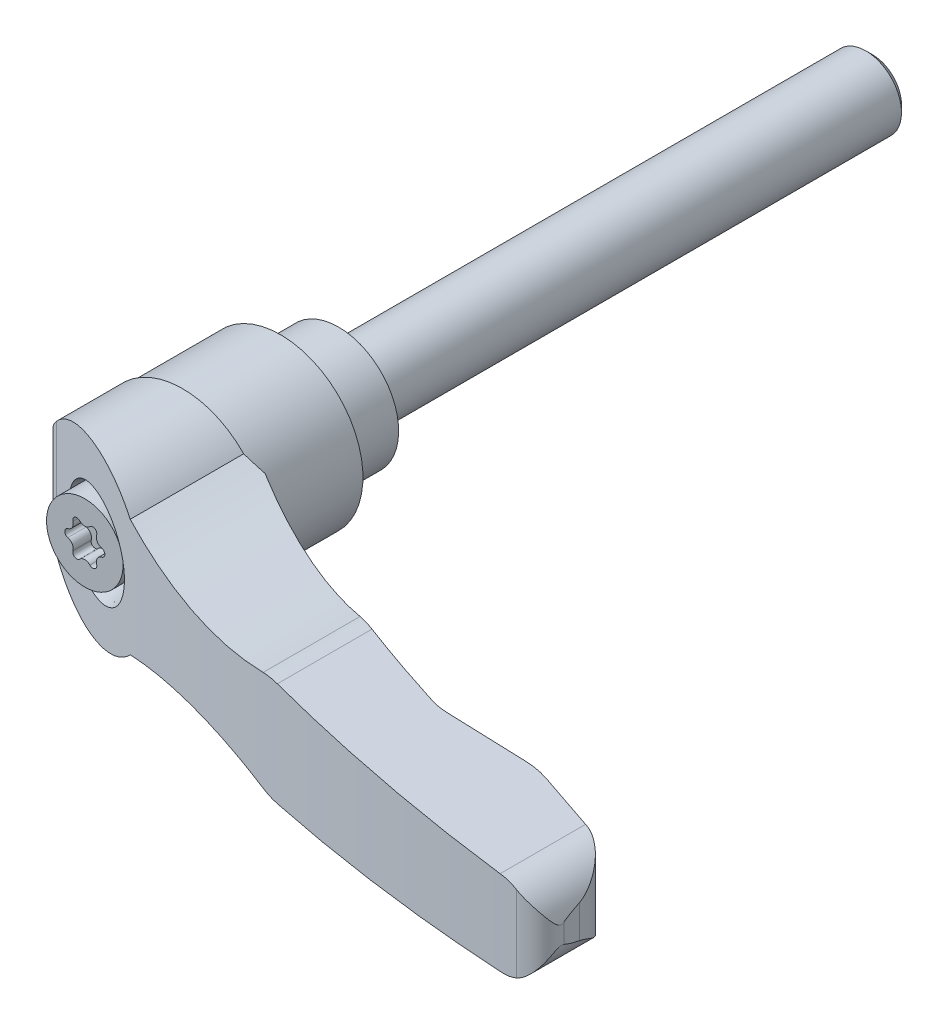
ISO-10303-21;
HEADER;
FILE_DESCRIPTION(('STEP AP214'),'2;1');
FILE_NAME('part.step','',(''),(''),'','','');
FILE_SCHEMA(('AUTOMOTIVE_DESIGN { 1 0 10303 214 1 1 1 1 }'));
ENDSEC;
DATA;
#1=APPLICATION_CONTEXT('core data for automotive mechanical design processes');
#2=APPLICATION_PROTOCOL_DEFINITION('international standard','automotive_design',2000,#1);
#3=PRODUCT_CONTEXT('',#1,'mechanical');
#4=PRODUCT('Part','Part','',(#3));
#5=PRODUCT_RELATED_PRODUCT_CATEGORY('part','',(#4));
#6=PRODUCT_DEFINITION_FORMATION('','',#4);
#7=PRODUCT_DEFINITION_CONTEXT('part definition',#1,'design');
#8=PRODUCT_DEFINITION('design','',#6,#7);
#9=PRODUCT_DEFINITION_SHAPE('','',#8);
#10=(LENGTH_UNIT() NAMED_UNIT(*) SI_UNIT(.MILLI.,.METRE.));
#11=(NAMED_UNIT(*) PLANE_ANGLE_UNIT() SI_UNIT($,.RADIAN.));
#12=(NAMED_UNIT(*) SI_UNIT($,.STERADIAN.) SOLID_ANGLE_UNIT());
#13=UNCERTAINTY_MEASURE_WITH_UNIT(LENGTH_MEASURE(1.E-05),#10,'distance_accuracy_value','');
#14=(GEOMETRIC_REPRESENTATION_CONTEXT(3) GLOBAL_UNCERTAINTY_ASSIGNED_CONTEXT((#13)) GLOBAL_UNIT_ASSIGNED_CONTEXT((#10,
#11,#12)) REPRESENTATION_CONTEXT('',''));
#15=CARTESIAN_POINT('',(0.,0.,0.));
#16=DIRECTION('',(0.,0.,1.));
#17=DIRECTION('',(1.,0.,0.));
#18=AXIS2_PLACEMENT_3D('',#15,#16,#17);
#19=CARTESIAN_POINT('',(0.,0.,-7.116040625));
#20=DIRECTION('',(0.,0.,-1.));
#21=DIRECTION('',(0.,1.,0.));
#22=AXIS2_PLACEMENT_3D('',#19,#20,#21);
#23=CYLINDRICAL_SURFACE('',#22,4.);
#24=CARTESIAN_POINT('',(0.,0.,-59.23));
#25=DIRECTION('',(0.,0.,-1.));
#26=DIRECTION('',(0.,1.,0.));
#27=AXIS2_PLACEMENT_3D('',#24,#25,#26);
#28=CIRCLE('',#27,4.);
#29=CARTESIAN_POINT('',(0.,4.,-59.23));
#30=VERTEX_POINT('',#29);
#31=EDGE_CURVE('E9',#30,#30,#28,.F.);
#32=ORIENTED_EDGE('',*,*,#31,.T.);
#33=EDGE_LOOP('',(#32));
#34=FACE_BOUND('',#33,.T.);
#35=CARTESIAN_POINT('',(0.,0.,0.));
#36=DIRECTION('',(0.,0.,-1.));
#37=DIRECTION('',(0.,1.,0.));
#38=AXIS2_PLACEMENT_3D('',#35,#36,#37);
#39=CIRCLE('',#38,4.);
#40=CARTESIAN_POINT('',(0.,4.,0.));
#41=VERTEX_POINT('',#40);
#42=EDGE_CURVE('E547',#41,#41,#39,.F.);
#43=ORIENTED_EDGE('',*,*,#42,.F.);
#44=EDGE_LOOP('',(#43));
#45=FACE_BOUND('',#44,.T.);
#46=ADVANCED_FACE('F14',(#34,#45),#23,.T.);
#47=CARTESIAN_POINT('',(5.375,0.,0.));
#48=DIRECTION('',(0.,0.,-1.));
#49=DIRECTION('',(0.,1.,0.));
#50=AXIS2_PLACEMENT_3D('',#47,#48,#49);
#51=PLANE('',#50);
#52=ORIENTED_EDGE('',*,*,#42,.T.);
#53=EDGE_LOOP('',(#52));
#54=FACE_BOUND('',#53,.T.);
#55=CARTESIAN_POINT('',(0.,0.,0.));
#56=DIRECTION('',(0.,0.,-1.));
#57=DIRECTION('',(0.,1.,0.));
#58=AXIS2_PLACEMENT_3D('',#55,#56,#57);
#59=CIRCLE('',#58,6.75);
#60=CARTESIAN_POINT('',(0.,6.75,0.));
#61=VERTEX_POINT('',#60);
#62=EDGE_CURVE('E732',#61,#61,#59,.F.);
#63=ORIENTED_EDGE('',*,*,#62,.F.);
#64=EDGE_LOOP('',(#63));
#65=FACE_BOUND('',#64,.T.);
#66=ADVANCED_FACE('F817',(#54,#65),#51,.T.);
#67=CARTESIAN_POINT('',(0.,0.,8.25));
#68=DIRECTION('',(0.,0.,-1.));
#69=DIRECTION('',(0.,1.,0.));
#70=AXIS2_PLACEMENT_3D('',#67,#68,#69);
#71=CYLINDRICAL_SURFACE('',#70,6.75);
#72=ORIENTED_EDGE('',*,*,#62,.T.);
#73=EDGE_LOOP('',(#72));
#74=FACE_BOUND('',#73,.T.);
#75=CARTESIAN_POINT('',(0.,0.,7.15000000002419));
#76=DIRECTION('',(0.,0.,-1.));
#77=DIRECTION('',(1.,0.,0.));
#78=AXIS2_PLACEMENT_3D('',#75,#76,#77);
#79=CIRCLE('',#78,6.74999999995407);
#80=CARTESIAN_POINT('',(6.74999999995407,0.,7.15000000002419));
#81=VERTEX_POINT('',#80);
#82=EDGE_CURVE('E540',#81,#81,#79,.T.);
#83=ORIENTED_EDGE('',*,*,#82,.T.);
#84=EDGE_LOOP('',(#83));
#85=FACE_BOUND('',#84,.T.);
#86=ADVANCED_FACE('F824',(#74,#85),#71,.T.);
#87=CARTESIAN_POINT('',(0.,0.,6.9000000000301));
#88=DIRECTION('',(0.,0.,-1.));
#89=DIRECTION('',(0.,1.,0.));
#90=AXIS2_PLACEMENT_3D('',#87,#88,#89);
#91=CONICAL_SURFACE('',#90,7.000000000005,0.785398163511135);
#92=ORIENTED_EDGE('',*,*,#82,.F.);
#93=EDGE_LOOP('',(#92));
#94=FACE_BOUND('',#93,.T.);
#95=CARTESIAN_POINT('',(0.,0.,6.9));
#96=DIRECTION('',(0.,0.,-1.));
#97=DIRECTION('',(0.,1.,0.));
#98=AXIS2_PLACEMENT_3D('',#95,#96,#97);
#99=CIRCLE('',#98,7.);
#100=CARTESIAN_POINT('',(0.,7.,6.9));
#101=VERTEX_POINT('',#100);
#102=EDGE_CURVE('E536',#101,#101,#99,.T.);
#103=ORIENTED_EDGE('',*,*,#102,.T.);
#104=EDGE_LOOP('',(#103));
#105=FACE_BOUND('',#104,.T.);
#106=ADVANCED_FACE('F832',(#94,#105),#91,.F.);
#107=CARTESIAN_POINT('',(0.,0.,6.2));
#108=DIRECTION('',(0.,0.,-1.));
#109=DIRECTION('',(0.,1.,0.));
#110=AXIS2_PLACEMENT_3D('',#107,#108,#109);
#111=CYLINDRICAL_SURFACE('',#110,7.);
#112=ORIENTED_EDGE('',*,*,#102,.F.);
#113=EDGE_LOOP('',(#112));
#114=FACE_BOUND('',#113,.T.);
#115=CARTESIAN_POINT('',(0.,0.,6.5));
#116=DIRECTION('',(0.,0.,-1.));
#117=DIRECTION('',(0.,1.,0.));
#118=AXIS2_PLACEMENT_3D('',#115,#116,#117);
#119=CIRCLE('',#118,7.);
#120=CARTESIAN_POINT('',(0.,7.,6.5));
#121=VERTEX_POINT('',#120);
#122=EDGE_CURVE('E539',#121,#121,#119,.F.);
#123=ORIENTED_EDGE('',*,*,#122,.F.);
#124=EDGE_LOOP('',(#123));
#125=FACE_BOUND('',#124,.T.);
#126=ADVANCED_FACE('F839',(#114,#125),#111,.F.);
#127=CARTESIAN_POINT('',(-9.01003775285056,-19.,6.5));
#128=DIRECTION('',(0.707106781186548,0.,0.707106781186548));
#129=DIRECTION('',(-0.707106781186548,0.,0.707106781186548));
#130=AXIS2_PLACEMENT_3D('',#127,#128,#129);
#131=PLANE('',#130);
#132=DIRECTION('',(0.,1.,0.));
#133=VECTOR('',#132,1.);
#134=CARTESIAN_POINT('',(-9.01003775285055,0.,6.5));
#135=LINE('',#134,#133);
#136=CARTESIAN_POINT('',(-9.01003775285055,-2.13584185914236,6.5));
#137=VERTEX_POINT('',#136);
#138=CARTESIAN_POINT('',(-9.01003775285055,2.13584185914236,6.5));
#139=VERTEX_POINT('',#138);
#140=EDGE_CURVE('E727',#137,#139,#135,.T.);
#141=ORIENTED_EDGE('',*,*,#140,.F.);
#142=CARTESIAN_POINT('',(-0.00999999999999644,0.,-2.50003775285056));
#143=DIRECTION('',(0.707106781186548,0.,0.707106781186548));
#144=DIRECTION('',(-0.707106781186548,0.,0.707106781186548));
#145=AXIS2_PLACEMENT_3D('',#142,#143,#144);
#146=ELLIPSE('',#145,13.0814754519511,9.25);
#147=EDGE_CURVE('E724',#139,#137,#146,.T.);
#148=ORIENTED_EDGE('',*,*,#147,.F.);
#149=EDGE_LOOP('',(#141,#148));
#150=FACE_BOUND('',#149,.T.);
#151=ADVANCED_FACE('F843',(#150),#131,.F.);
#152=CARTESIAN_POINT('',(-4.635,0.,6.5));
#153=DIRECTION('',(0.,0.,-1.));
#154=DIRECTION('',(0.,1.,0.));
#155=AXIS2_PLACEMENT_3D('',#152,#153,#154);
#156=PLANE('',#155);
#157=ORIENTED_EDGE('',*,*,#140,.T.);
#158=CARTESIAN_POINT('',(-0.00999999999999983,0.,6.5));
#159=DIRECTION('',(0.,0.,1.));
#160=DIRECTION('',(-1.,0.,0.));
#161=AXIS2_PLACEMENT_3D('',#158,#159,#160);
#162=CIRCLE('',#161,9.25);
#163=EDGE_CURVE('E720',#137,#139,#162,.T.);
#164=ORIENTED_EDGE('',*,*,#163,.F.);
#165=EDGE_LOOP('',(#157,#164));
#166=FACE_BOUND('',#165,.T.);
#167=ORIENTED_EDGE('',*,*,#122,.T.);
#168=EDGE_LOOP('',(#167));
#169=FACE_BOUND('',#168,.T.);
#170=ADVANCED_FACE('F847',(#166,#169),#156,.T.);
#171=CARTESIAN_POINT('',(-0.0100000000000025,0.,13.5625));
#172=DIRECTION('',(0.,0.,1.));
#173=DIRECTION('',(-1.,0.,0.));
#174=AXIS2_PLACEMENT_3D('',#171,#172,#173);
#175=CYLINDRICAL_SURFACE('',#174,9.25);
#176=ORIENTED_EDGE('',*,*,#163,.T.);
#177=ORIENTED_EDGE('',*,*,#147,.T.);
#178=EDGE_LOOP('',(#176,#177));
#179=FACE_BOUND('',#178,.T.);
#180=CARTESIAN_POINT('',(-0.010000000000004,0.,17.5));
#181=DIRECTION('',(0.,0.,1.));
#182=DIRECTION('',(-1.,0.,0.));
#183=AXIS2_PLACEMENT_3D('',#180,#181,#182);
#184=CIRCLE('',#183,9.25);
#185=CARTESIAN_POINT('',(-9.26,0.,17.5));
#186=VERTEX_POINT('',#185);
#187=CARTESIAN_POINT('',(9.23999999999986,0.,17.5000000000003));
#188=VERTEX_POINT('',#187);
#189=EDGE_CURVE('E710',#186,#188,#184,.T.);
#190=ORIENTED_EDGE('',*,*,#189,.F.);
#191=CARTESIAN_POINT('',(-0.010000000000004,0.,17.5));
#192=DIRECTION('',(0.,0.,1.));
#193=DIRECTION('',(-1.,0.,0.));
#194=AXIS2_PLACEMENT_3D('',#191,#192,#193);
#195=CIRCLE('',#194,9.25);
#196=EDGE_CURVE('E531',#188,#186,#195,.T.);
#197=ORIENTED_EDGE('',*,*,#196,.F.);
#198=EDGE_LOOP('',(#190,#197));
#199=FACE_BOUND('',#198,.T.);
#200=ADVANCED_FACE('F717',(#179,#199),#175,.T.);
#201=CARTESIAN_POINT('',(64.6274051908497,-10.5,37.5817950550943));
#202=DIRECTION('',(0.992331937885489,0.,-0.123601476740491));
#203=DIRECTION('',(0.123601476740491,0.,0.992331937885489));
#204=AXIS2_PLACEMENT_3D('',#201,#202,#203);
#205=PLANE('',#204);
#206=CARTESIAN_POINT('',(60.25,0.,2.43788666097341));
#207=DIRECTION('',(0.992331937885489,0.,-0.123601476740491));
#208=DIRECTION('',(0.123601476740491,0.,0.992331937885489));
#209=AXIS2_PLACEMENT_3D('',#206,#207,#208);
#210=ELLIPSE('',#209,38.4299615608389,4.75);
#211=CARTESIAN_POINT('',(64.8745408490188,1.08449155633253,39.5659186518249));
#212=VERTEX_POINT('',#211);
#213=CARTESIAN_POINT('',(64.6274051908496,1.84413226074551,37.5817950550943));
#214=VERTEX_POINT('',#213);
#215=EDGE_CURVE('E421',#212,#214,#210,.F.);
#216=ORIENTED_EDGE('',*,*,#215,.F.);
#217=DIRECTION('',(0.,-1.,0.));
#218=VECTOR('',#217,1.);
#219=CARTESIAN_POINT('',(64.8745408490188,-10.5,39.5659186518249));
#220=LINE('',#219,#218);
#221=CARTESIAN_POINT('',(64.8745408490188,-1.08449155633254,39.5659186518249));
#222=VERTEX_POINT('',#221);
#223=EDGE_CURVE('E460',#222,#212,#220,.F.);
#224=ORIENTED_EDGE('',*,*,#223,.F.);
#225=CARTESIAN_POINT('',(60.25,0.,2.43788666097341));
#226=DIRECTION('',(0.992331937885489,0.,-0.123601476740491));
#227=DIRECTION('',(0.123601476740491,0.,0.992331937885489));
#228=AXIS2_PLACEMENT_3D('',#225,#226,#227);
#229=ELLIPSE('',#228,38.4299615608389,4.75);
#230=CARTESIAN_POINT('',(64.6274051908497,-1.84413226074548,37.5817950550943));
#231=VERTEX_POINT('',#230);
#232=EDGE_CURVE('E444',#231,#222,#229,.F.);
#233=ORIENTED_EDGE('',*,*,#232,.F.);
#234=DIRECTION('',(0.,-1.,0.));
#235=VECTOR('',#234,1.);
#236=CARTESIAN_POINT('',(64.6274051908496,-10.5,37.5817950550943));
#237=LINE('',#236,#235);
#238=EDGE_CURVE('E718',#214,#231,#237,.T.);
#239=ORIENTED_EDGE('',*,*,#238,.F.);
#240=EDGE_LOOP('',(#216,#224,#233,#239));
#241=FACE_BOUND('',#240,.T.);
#242=ADVANCED_FACE('F430',(#241),#205,.T.);
#243=CARTESIAN_POINT('',(58.6337202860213,-10.5,38.3283479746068));
#244=DIRECTION('',(0.,-1.,0.));
#245=DIRECTION('',(1.,0.,0.));
#246=AXIS2_PLACEMENT_3D('',#243,#244,#245);
#247=CYLINDRICAL_SURFACE('',#246,6.04);
#248=CARTESIAN_POINT('',(64.6274051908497,1.84413226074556,37.5817950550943));
#249=CARTESIAN_POINT('',(64.6175868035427,1.86745330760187,37.5030045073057));
#250=CARTESIAN_POINT('',(64.6063375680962,1.89362327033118,37.4253204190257));
#251=CARTESIAN_POINT('',(64.5811702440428,1.95049016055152,37.2721928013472));
#252=CARTESIAN_POINT('',(64.5672561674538,1.98118026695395,37.1967460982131));
#253=CARTESIAN_POINT('',(64.5369883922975,2.04585034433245,37.0482136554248));
#254=CARTESIAN_POINT('',(64.520645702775,2.07981523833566,36.9751189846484));
#255=CARTESIAN_POINT('',(64.4855821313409,2.15032519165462,36.8307396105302));
#256=CARTESIAN_POINT('',(64.4668602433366,2.18687133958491,36.7594556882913));
#257=CARTESIAN_POINT('',(64.4072221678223,2.29938724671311,36.547961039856));
#258=CARTESIAN_POINT('',(64.3628565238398,2.37818379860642,36.410218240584));
#259=CARTESIAN_POINT('',(64.2652007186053,2.53960895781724,36.1400450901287));
#260=CARTESIAN_POINT('',(64.2118976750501,2.6222429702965,36.007622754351));
#261=CARTESIAN_POINT('',(64.077119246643,2.81672317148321,35.7040219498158));
#262=CARTESIAN_POINT('',(63.9921849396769,2.92909268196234,35.5347005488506));
#263=CARTESIAN_POINT('',(63.8063278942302,3.15216626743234,35.2039790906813));
#264=CARTESIAN_POINT('',(63.7054078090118,3.26287061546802,35.0425777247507));
#265=CARTESIAN_POINT('',(63.4870671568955,3.47959027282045,34.7278934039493));
#266=CARTESIAN_POINT('',(63.369645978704,3.58560540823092,34.5746107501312));
#267=CARTESIAN_POINT('',(63.1179209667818,3.78996521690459,34.277236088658));
#268=CARTESIAN_POINT('',(62.9836257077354,3.88831374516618,34.1331394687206));
#269=CARTESIAN_POINT('',(62.6561598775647,4.10136712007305,33.815313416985));
#270=CARTESIAN_POINT('',(62.4571888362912,4.21258905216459,33.6450495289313));
#271=CARTESIAN_POINT('',(62.1378586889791,4.36029911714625,33.4069452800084));
#272=CARTESIAN_POINT('',(62.0281124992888,4.40629516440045,33.3305585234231));
#273=CARTESIAN_POINT('',(61.8018114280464,4.49098569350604,33.1841350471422));
#274=CARTESIAN_POINT('',(61.6852609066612,4.52968478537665,33.1140943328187));
#275=CARTESIAN_POINT('',(61.4786111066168,4.58924867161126,32.9993621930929));
#276=CARTESIAN_POINT('',(61.3900115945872,4.61209493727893,32.9529824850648));
#277=CARTESIAN_POINT('',(61.2097340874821,4.65295056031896,32.8642982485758));
#278=CARTESIAN_POINT('',(61.1180570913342,4.67096147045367,32.82199241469));
#279=CARTESIAN_POINT('',(60.9313596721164,4.70183469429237,32.7415027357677));
#280=CARTESIAN_POINT('',(60.8363219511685,4.71466416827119,32.7033462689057));
#281=CARTESIAN_POINT('',(60.6438287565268,4.73463763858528,32.631712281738));
#282=CARTESIAN_POINT('',(60.5463713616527,4.74177695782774,32.5982386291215));
#283=CARTESIAN_POINT('',(60.4479724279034,4.74587261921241,32.5672639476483));
#284=B_SPLINE_CURVE_WITH_KNOTS('',3,(#248,#249,#250,#251,#252,#253,#254,#255,#256,#257,#258,
#259,#260,#261,#262,#263,#264,#265,#266,#267,#268,#269,#270,#271,#272,#273,#274,#275,#276,#277,
#278,#279,#280,#281,#282,#283),.UNSPECIFIED.,.F.,.F.,(4,2,2,2,2,2,2,2,2,2,2,2,2,2,2,2,2,4),(0.,
0.248076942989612,0.495783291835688,0.742399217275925,0.989119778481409,1.48293160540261,
1.97746142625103,2.63745339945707,3.29733594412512,3.95724294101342,4.61681594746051,
5.46693586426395,5.89075482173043,6.31430511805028,6.62183365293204,6.92926331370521,
7.23861197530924,7.54821464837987),.UNSPECIFIED.);
#285=CARTESIAN_POINT('',(60.4479724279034,4.74587261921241,32.5672639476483));
#286=VERTEX_POINT('',#285);
#287=EDGE_CURVE('E412',#214,#286,#284,.T.);
#288=ORIENTED_EDGE('',*,*,#287,.F.);
#289=ORIENTED_EDGE('',*,*,#238,.T.);
#290=CARTESIAN_POINT('',(60.4479724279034,-4.74587261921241,32.5672639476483));
#291=CARTESIAN_POINT('',(60.5755504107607,-4.74057354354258,32.6074069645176));
#292=CARTESIAN_POINT('',(60.7015088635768,-4.73014540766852,32.6517620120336));
#293=CARTESIAN_POINT('',(60.9490652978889,-4.69992242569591,32.7481786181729));
#294=CARTESIAN_POINT('',(61.0706698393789,-4.6801423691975,32.8002279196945));
#295=CARTESIAN_POINT('',(61.3074659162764,-4.63235500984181,32.9108206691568));
#296=CARTESIAN_POINT('',(61.4227141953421,-4.60444273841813,32.9692844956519));
#297=CARTESIAN_POINT('',(61.6477173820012,-4.54120548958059,33.0925213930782));
#298=CARTESIAN_POINT('',(61.7574696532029,-4.50587699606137,33.1572974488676));
#299=CARTESIAN_POINT('',(61.9940137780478,-4.42040174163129,33.307032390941));
#300=CARTESIAN_POINT('',(62.1193938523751,-4.36870213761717,33.3933358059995));
#301=CARTESIAN_POINT('',(62.3610721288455,-4.25718277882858,33.5732278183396));
#302=CARTESIAN_POINT('',(62.4773638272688,-4.19735729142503,33.6668215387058));
#303=CARTESIAN_POINT('',(62.7012840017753,-4.07066877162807,33.8608437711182));
#304=CARTESIAN_POINT('',(62.8088611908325,-4.0037687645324,33.9613071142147));
#305=CARTESIAN_POINT('',(63.0146476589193,-3.86453813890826,34.1677809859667));
#306=CARTESIAN_POINT('',(63.1128596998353,-3.79220913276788,34.2737898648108));
#307=CARTESIAN_POINT('',(63.3331746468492,-3.61700510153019,34.5290929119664));
#308=CARTESIAN_POINT('',(63.4514763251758,-3.51235864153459,34.6804594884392));
#309=CARTESIAN_POINT('',(63.6718053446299,-3.29808480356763,34.9913387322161));
#310=CARTESIAN_POINT('',(63.7738256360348,-3.18845529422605,35.1508548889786));
#311=CARTESIAN_POINT('',(63.961662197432,-2.9676568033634,35.4770445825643));
#312=CARTESIAN_POINT('',(64.0475378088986,-2.85649513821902,35.6436890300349));
#313=CARTESIAN_POINT('',(64.2038484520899,-2.63586419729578,35.9851508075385));
#314=CARTESIAN_POINT('',(64.2742871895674,-2.52639452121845,36.1599661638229));
#315=CARTESIAN_POINT('',(64.3705847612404,-2.36382517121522,36.4361542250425));
#316=CARTESIAN_POINT('',(64.4019853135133,-2.30809068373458,36.5340606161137));
#317=CARTESIAN_POINT('',(64.4601539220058,-2.20019362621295,36.7330390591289));
#318=CARTESIAN_POINT('',(64.4869269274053,-2.14802727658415,36.8341075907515));
#319=CARTESIAN_POINT('',(64.5357331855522,-2.04890785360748,37.0402846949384));
#320=CARTESIAN_POINT('',(64.5577546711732,-2.00196785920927,37.1454025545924));
#321=CARTESIAN_POINT('',(64.596614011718,-1.91618262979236,37.360168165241));
#322=CARTESIAN_POINT('',(64.6134353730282,-1.87736327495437,37.4698291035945));
#323=CARTESIAN_POINT('',(64.6274051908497,-1.84413226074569,37.5817950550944));
#324=B_SPLINE_CURVE_WITH_KNOTS('',3,(#290,#291,#292,#293,#294,#295,#296,#297,#298,#299,#300,
#301,#302,#303,#304,#305,#306,#307,#308,#309,#310,#311,#312,#313,#314,#315,#316,#317,#318,#319,
#320,#321,#322,#323),.UNSPECIFIED.,.F.,.F.,(4,2,2,2,2,2,2,2,2,2,2,2,2,2,2,2,4),(0.,
0.401264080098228,0.801895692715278,1.19802151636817,1.59433557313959,2.0758833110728,
2.55777255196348,3.04231807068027,3.52672024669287,4.18208013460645,4.83772302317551,
5.49090678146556,6.1439335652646,6.49464389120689,6.84497677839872,7.19616755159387,
7.54846105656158),.UNSPECIFIED.);
#325=CARTESIAN_POINT('',(60.4479724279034,-4.74587261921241,32.5672639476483));
#326=VERTEX_POINT('',#325);
#327=EDGE_CURVE('E436',#326,#231,#324,.T.);
#328=ORIENTED_EDGE('',*,*,#327,.F.);
#329=DIRECTION('',(0.,-1.,0.));
#330=VECTOR('',#329,1.);
#331=CARTESIAN_POINT('',(60.4479724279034,-10.5,32.5672639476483));
#332=LINE('',#331,#330);
#333=EDGE_CURVE('E526',#286,#326,#332,.T.);
#334=ORIENTED_EDGE('',*,*,#333,.F.);
#335=EDGE_LOOP('',(#288,#289,#328,#334));
#336=FACE_BOUND('',#335,.T.);
#337=ADVANCED_FACE('F424',(#336),#247,.T.);
#338=CARTESIAN_POINT('',(-9.26,-10.5,17.5));
#339=DIRECTION('',(0.,0.,-1.));
#340=DIRECTION('',(0.,1.,0.));
#341=AXIS2_PLACEMENT_3D('',#338,#339,#340);
#342=PLANE('',#341);
#343=DIRECTION('',(0.,-1.,0.));
#344=VECTOR('',#343,1.);
#345=CARTESIAN_POINT('',(-9.26,-10.5,17.5));
#346=LINE('',#345,#344);
#347=CARTESIAN_POINT('',(-9.26,2.12188595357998,17.5));
#348=VERTEX_POINT('',#347);
#349=EDGE_CURVE('E527',#348,#186,#346,.T.);
#350=ORIENTED_EDGE('',*,*,#349,.F.);
#351=CARTESIAN_POINT('',(0.,0.,17.5));
#352=DIRECTION('',(0.,0.,1.));
#353=DIRECTION('',(0.,-1.,0.));
#354=AXIS2_PLACEMENT_3D('',#351,#352,#353);
#355=CIRCLE('',#354,9.5);
#356=CARTESIAN_POINT('',(6.84374087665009,6.58887022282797,17.5));
#357=VERTEX_POINT('',#356);
#358=EDGE_CURVE('E338',#357,#348,#355,.T.);
#359=ORIENTED_EDGE('',*,*,#358,.F.);
#360=CARTESIAN_POINT('',(19.25,44.09,17.5));
#361=DIRECTION('',(0.,0.,1.));
#362=DIRECTION('',(0.,-1.,0.));
#363=AXIS2_PLACEMENT_3D('',#360,#361,#362);
#364=CIRCLE('',#363,39.5);
#365=CARTESIAN_POINT('',(9.23999999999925,5.87940068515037,17.5000000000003));
#366=VERTEX_POINT('',#365);
#367=EDGE_CURVE('E339',#357,#366,#364,.T.);
#368=ORIENTED_EDGE('',*,*,#367,.T.);
#369=DIRECTION('',(0.,-1.,0.));
#370=VECTOR('',#369,1.);
#371=CARTESIAN_POINT('',(9.23999999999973,-10.5,17.5000000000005));
#372=LINE('',#371,#370);
#373=EDGE_CURVE('E471',#366,#188,#372,.T.);
#374=ORIENTED_EDGE('',*,*,#373,.T.);
#375=ORIENTED_EDGE('',*,*,#196,.T.);
#376=EDGE_LOOP('',(#350,#359,#368,#374,#375));
#377=FACE_BOUND('',#376,.T.);
#378=ADVANCED_FACE('F429',(#377),#342,.T.);
#379=CARTESIAN_POINT('',(-9.26,-10.5,21.2038249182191));
#380=DIRECTION('',(-1.,0.,0.));
#381=DIRECTION('',(0.,-1.,0.));
#382=AXIS2_PLACEMENT_3D('',#379,#380,#381);
#383=PLANE('',#382);
#384=ORIENTED_EDGE('',*,*,#349,.T.);
#385=DIRECTION('',(0.,1.,0.));
#386=VECTOR('',#385,1.);
#387=CARTESIAN_POINT('',(-9.26,-10.5,17.5));
#388=LINE('',#387,#386);
#389=CARTESIAN_POINT('',(-9.26,-2.12188595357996,17.5));
#390=VERTEX_POINT('',#389);
#391=EDGE_CURVE('E706',#390,#186,#388,.T.);
#392=ORIENTED_EDGE('',*,*,#391,.F.);
#393=DIRECTION('',(0.,0.,1.));
#394=VECTOR('',#393,1.);
#395=CARTESIAN_POINT('',(-9.26,-2.12188595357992,42.5));
#396=LINE('',#395,#394);
#397=CARTESIAN_POINT('',(-9.26,-2.12188595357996,21.2038249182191));
#398=VERTEX_POINT('',#397);
#399=EDGE_CURVE('E530',#398,#390,#396,.F.);
#400=ORIENTED_EDGE('',*,*,#399,.F.);
#401=DIRECTION('',(0.,-1.,0.));
#402=VECTOR('',#401,1.);
#403=CARTESIAN_POINT('',(-9.26,-10.5,21.2038249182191));
#404=LINE('',#403,#402);
#405=CARTESIAN_POINT('',(-9.26,2.12188595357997,21.2038249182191));
#406=VERTEX_POINT('',#405);
#407=EDGE_CURVE('E493',#406,#398,#404,.T.);
#408=ORIENTED_EDGE('',*,*,#407,.F.);
#409=DIRECTION('',(0.,0.,1.));
#410=VECTOR('',#409,1.);
#411=CARTESIAN_POINT('',(-9.26,2.12188595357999,42.5));
#412=LINE('',#411,#410);
#413=EDGE_CURVE('E491',#348,#406,#412,.T.);
#414=ORIENTED_EDGE('',*,*,#413,.F.);
#415=EDGE_LOOP('',(#384,#392,#400,#408,#414));
#416=FACE_BOUND('',#415,.T.);
#417=ADVANCED_FACE('F708',(#416),#383,.T.);
#418=CARTESIAN_POINT('',(-9.26,-10.5,17.5));
#419=DIRECTION('',(0.,0.,-1.));
#420=DIRECTION('',(0.,1.,0.));
#421=AXIS2_PLACEMENT_3D('',#418,#419,#420);
#422=PLANE('',#421);
#423=DIRECTION('',(0.,-1.,0.));
#424=VECTOR('',#423,1.);
#425=CARTESIAN_POINT('',(9.23999999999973,-10.5,17.5000000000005));
#426=LINE('',#425,#424);
#427=CARTESIAN_POINT('',(9.23999999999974,-5.87940068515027,17.5000000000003));
#428=VERTEX_POINT('',#427);
#429=EDGE_CURVE('E639',#188,#428,#426,.T.);
#430=ORIENTED_EDGE('',*,*,#429,.T.);
#431=CARTESIAN_POINT('',(19.25,-44.09,17.5));
#432=DIRECTION('',(0.,0.,1.));
#433=DIRECTION('',(0.,-1.,0.));
#434=AXIS2_PLACEMENT_3D('',#431,#432,#433);
#435=CIRCLE('',#434,39.5);
#436=CARTESIAN_POINT('',(6.84374087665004,-6.588870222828,17.5));
#437=VERTEX_POINT('',#436);
#438=EDGE_CURVE('E305',#428,#437,#435,.T.);
#439=ORIENTED_EDGE('',*,*,#438,.T.);
#440=CARTESIAN_POINT('',(0.,0.,17.5));
#441=DIRECTION('',(0.,0.,1.));
#442=DIRECTION('',(0.,-1.,0.));
#443=AXIS2_PLACEMENT_3D('',#440,#441,#442);
#444=CIRCLE('',#443,9.5);
#445=EDGE_CURVE('E496',#390,#437,#444,.T.);
#446=ORIENTED_EDGE('',*,*,#445,.F.);
#447=ORIENTED_EDGE('',*,*,#391,.T.);
#448=ORIENTED_EDGE('',*,*,#189,.T.);
#449=EDGE_LOOP('',(#430,#439,#446,#447,#448));
#450=FACE_BOUND('',#449,.T.);
#451=ADVANCED_FACE('F701',(#450),#422,.T.);
#452=CARTESIAN_POINT('',(53.8294507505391,-10.5,30.4829917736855));
#453=DIRECTION('',(0.300372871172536,0.,-0.95382185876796));
#454=DIRECTION('',(0.95382185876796,0.,0.300372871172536));
#455=AXIS2_PLACEMENT_3D('',#452,#453,#454);
#456=PLANE('',#455);
#457=CARTESIAN_POINT('',(60.25,0.,32.5049194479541));
#458=DIRECTION('',(0.300372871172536,0.,-0.95382185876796));
#459=DIRECTION('',(0.95382185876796,0.,0.300372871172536));
#460=AXIS2_PLACEMENT_3D('',#457,#458,#459);
#461=ELLIPSE('',#460,4.97996555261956,4.75);
#462=CARTESIAN_POINT('',(60.25,4.75,32.5049194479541));
#463=VERTEX_POINT('',#462);
#464=EDGE_CURVE('E461',#286,#463,#461,.F.);
#465=ORIENTED_EDGE('',*,*,#464,.F.);
#466=ORIENTED_EDGE('',*,*,#333,.T.);
#467=CARTESIAN_POINT('',(60.25,0.,32.5049194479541));
#468=DIRECTION('',(0.300372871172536,0.,-0.95382185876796));
#469=DIRECTION('',(0.95382185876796,0.,0.300372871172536));
#470=AXIS2_PLACEMENT_3D('',#467,#468,#469);
#471=ELLIPSE('',#470,4.97996555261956,4.75);
#472=CARTESIAN_POINT('',(60.25,-4.75,32.5049194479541));
#473=VERTEX_POINT('',#472);
#474=EDGE_CURVE('E445',#473,#326,#471,.F.);
#475=ORIENTED_EDGE('',*,*,#474,.F.);
#476=DIRECTION('',(-0.953255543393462,-0.0344545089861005,-0.300194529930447));
#477=VECTOR('',#476,1.);
#478=CARTESIAN_POINT('',(60.25,-4.75,32.5049194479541));
#479=LINE('',#478,#477);
#480=CARTESIAN_POINT('',(53.8294507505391,-4.98206460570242,30.4829917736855));
#481=VERTEX_POINT('',#480);
#482=EDGE_CURVE('E508',#473,#481,#479,.T.);
#483=ORIENTED_EDGE('',*,*,#482,.T.);
#484=DIRECTION('',(0.,-1.,0.));
#485=VECTOR('',#484,1.);
#486=CARTESIAN_POINT('',(53.8294507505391,-10.5,30.4829917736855));
#487=LINE('',#486,#485);
#488=CARTESIAN_POINT('',(53.8294507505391,4.98206460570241,30.4829917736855));
#489=VERTEX_POINT('',#488);
#490=EDGE_CURVE('E523',#489,#481,#487,.T.);
#491=ORIENTED_EDGE('',*,*,#490,.F.);
#492=DIRECTION('',(0.953255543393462,-0.0344545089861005,0.300194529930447));
#493=VECTOR('',#492,1.);
#494=CARTESIAN_POINT('',(53.8294507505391,4.98206460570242,30.4829917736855));
#495=LINE('',#494,#493);
#496=EDGE_CURVE('E473',#489,#463,#495,.T.);
#497=ORIENTED_EDGE('',*,*,#496,.T.);
#498=EDGE_LOOP('',(#465,#466,#475,#483,#491,#497));
#499=FACE_BOUND('',#498,.T.);
#500=ADVANCED_FACE('F868',(#499),#456,.T.);
#501=CARTESIAN_POINT('',(51.0780352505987,-10.5,39.22));
#502=DIRECTION('',(0.,-1.,0.));
#503=DIRECTION('',(1.,0.,0.));
#504=AXIS2_PLACEMENT_3D('',#501,#502,#503);
#505=CYLINDRICAL_SURFACE('',#504,9.15999999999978);
#506=CARTESIAN_POINT('',(51.0780352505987,5.08151188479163,39.22));
#507=DIRECTION('',(-0.0361204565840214,-0.999347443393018,0.));
#508=DIRECTION('',(0.999347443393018,-0.0361204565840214,0.));
#509=AXIS2_PLACEMENT_3D('',#506,#507,#508);
#510=ELLIPSE('',#509,9.16598132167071,9.15999999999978);
#511=CARTESIAN_POINT('',(51.0780352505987,5.08151188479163,30.06));
#512=VERTEX_POINT('',#511);
#513=EDGE_CURVE('E476',#512,#489,#510,.T.);
#514=ORIENTED_EDGE('',*,*,#513,.T.);
#515=ORIENTED_EDGE('',*,*,#490,.T.);
#516=CARTESIAN_POINT('',(51.0780352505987,-5.08151188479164,39.22));
#517=DIRECTION('',(-0.0361204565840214,0.999347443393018,0.));
#518=DIRECTION('',(-0.999347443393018,-0.0361204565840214,0.));
#519=AXIS2_PLACEMENT_3D('',#516,#517,#518);
#520=ELLIPSE('',#519,9.16598132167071,9.15999999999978);
#521=CARTESIAN_POINT('',(51.0780352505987,-5.08151188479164,30.06));
#522=VERTEX_POINT('',#521);
#523=EDGE_CURVE('E303',#481,#522,#520,.T.);
#524=ORIENTED_EDGE('',*,*,#523,.T.);
#525=DIRECTION('',(0.,1.,0.));
#526=VECTOR('',#525,1.);
#527=CARTESIAN_POINT('',(51.0780352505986,-10.5,30.06));
#528=LINE('',#527,#526);
#529=EDGE_CURVE('E520',#512,#522,#528,.F.);
#530=ORIENTED_EDGE('',*,*,#529,.F.);
#531=EDGE_LOOP('',(#514,#515,#524,#530));
#532=FACE_BOUND('',#531,.T.);
#533=ADVANCED_FACE('F877',(#532),#505,.T.);
#534=CARTESIAN_POINT('',(42.239481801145,-10.5,30.06));
#535=DIRECTION('',(0.,0.,-1.));
#536=DIRECTION('',(0.,1.,0.));
#537=AXIS2_PLACEMENT_3D('',#534,#535,#536);
#538=PLANE('',#537);
#539=DIRECTION('',(0.999347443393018,-0.0361204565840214,0.));
#540=VECTOR('',#539,1.);
#541=CARTESIAN_POINT('',(30.3472861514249,5.83080496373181,30.06));
#542=LINE('',#541,#540);
#543=CARTESIAN_POINT('',(42.239481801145,5.4009729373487,30.06));
#544=VERTEX_POINT('',#543);
#545=EDGE_CURVE('E477',#544,#512,#542,.T.);
#546=ORIENTED_EDGE('',*,*,#545,.T.);
#547=ORIENTED_EDGE('',*,*,#529,.T.);
#548=DIRECTION('',(-0.999347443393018,-0.0361204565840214,0.));
#549=VECTOR('',#548,1.);
#550=CARTESIAN_POINT('',(60.25,-4.75,30.06));
#551=LINE('',#550,#549);
#552=CARTESIAN_POINT('',(42.239481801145,-5.4009729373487,30.06));
#553=VERTEX_POINT('',#552);
#554=EDGE_CURVE('E505',#522,#553,#551,.T.);
#555=ORIENTED_EDGE('',*,*,#554,.T.);
#556=DIRECTION('',(0.,-1.,0.));
#557=VECTOR('',#556,1.);
#558=CARTESIAN_POINT('',(42.239481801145,-10.5,30.06));
#559=LINE('',#558,#557);
#560=EDGE_CURVE('E518',#553,#544,#559,.F.);
#561=ORIENTED_EDGE('',*,*,#560,.T.);
#562=EDGE_LOOP('',(#546,#547,#555,#561));
#563=FACE_BOUND('',#562,.T.);
#564=ADVANCED_FACE('F880',(#563),#538,.T.);
#565=CARTESIAN_POINT('',(42.2394818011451,-10.5,23.0799999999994));
#566=DIRECTION('',(0.,-1.,0.));
#567=DIRECTION('',(1.,0.,0.));
#568=AXIS2_PLACEMENT_3D('',#565,#566,#567);
#569=CYLINDRICAL_SURFACE('',#568,6.98000000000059);
#570=DIRECTION('',(0.,-1.,0.));
#571=VECTOR('',#570,1.);
#572=CARTESIAN_POINT('',(40.3024609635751,-10.5,29.785844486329));
#573=LINE('',#572,#571);
#574=CARTESIAN_POINT('',(40.3024609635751,-5.47098470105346,29.7858444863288));
#575=VERTEX_POINT('',#574);
#576=CARTESIAN_POINT('',(40.3024609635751,5.47098470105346,29.7858444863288));
#577=VERTEX_POINT('',#576);
#578=EDGE_CURVE('E535',#575,#577,#573,.F.);
#579=ORIENTED_EDGE('',*,*,#578,.T.);
#580=CARTESIAN_POINT('',(42.2394818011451,5.40097293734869,23.0799999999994));
#581=DIRECTION('',(-0.0361204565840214,-0.999347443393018,0.));
#582=DIRECTION('',(0.999347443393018,-0.0361204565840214,0.));
#583=AXIS2_PLACEMENT_3D('',#580,#581,#582);
#584=ELLIPSE('',#583,6.98455781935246,6.98000000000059);
#585=EDGE_CURVE('E480',#577,#544,#584,.F.);
#586=ORIENTED_EDGE('',*,*,#585,.T.);
#587=ORIENTED_EDGE('',*,*,#560,.F.);
#588=CARTESIAN_POINT('',(42.2394818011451,-5.4009729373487,23.0799999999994));
#589=DIRECTION('',(-0.0361204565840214,0.999347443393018,0.));
#590=DIRECTION('',(-0.999347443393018,-0.0361204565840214,0.));
#591=AXIS2_PLACEMENT_3D('',#588,#589,#590);
#592=ELLIPSE('',#591,6.98455781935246,6.98000000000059);
#593=EDGE_CURVE('E507',#553,#575,#592,.F.);
#594=ORIENTED_EDGE('',*,*,#593,.T.);
#595=EDGE_LOOP('',(#579,#586,#587,#594));
#596=FACE_BOUND('',#595,.T.);
#597=ADVANCED_FACE('F313',(#596),#569,.F.);
#598=CARTESIAN_POINT('',(88.9416647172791,-10.5,-138.600024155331));
#599=DIRECTION('',(0.,-1.,0.));
#600=DIRECTION('',(1.,0.,0.));
#601=AXIS2_PLACEMENT_3D('',#598,#599,#600);
#602=CYLINDRICAL_SURFACE('',#601,175.27);
#603=CARTESIAN_POINT('',(30.3472861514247,5.83080496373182,26.5855433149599));
#604=CARTESIAN_POINT('',(30.1696679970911,5.83722947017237,26.5225405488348));
#605=CARTESIAN_POINT('',(29.9919650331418,5.83772087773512,26.45918181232));
#606=CARTESIAN_POINT('',(29.6377732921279,5.82691956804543,26.3322542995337));
#607=CARTESIAN_POINT('',(29.461282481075,5.81567269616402,26.2686872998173));
#608=CARTESIAN_POINT('',(29.1095062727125,5.78152581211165,26.1413510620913));
#609=CARTESIAN_POINT('',(28.9342208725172,5.75862582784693,26.0775818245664));
#610=CARTESIAN_POINT('',(28.5848474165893,5.70116062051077,25.9498538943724));
#611=CARTESIAN_POINT('',(28.4107667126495,5.6665501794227,25.8858954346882));
#612=CARTESIAN_POINT('',(28.2379732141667,5.62616845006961,25.8220994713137));
#613=B_SPLINE_CURVE_WITH_KNOTS('',3,(#603,#604,#605,#606,#607,#608,#609,#610,#611,#612),
.UNSPECIFIED.,.F.,.F.,(4,2,2,2,4),(0.,0.565613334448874,1.1290258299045,1.69243697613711,
2.2580489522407),.UNSPECIFIED.);
#614=CARTESIAN_POINT('',(30.3472861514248,5.83080496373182,26.5855433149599));
#615=VERTEX_POINT('',#614);
#616=CARTESIAN_POINT('',(28.2379732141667,5.62616845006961,25.8220994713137));
#617=VERTEX_POINT('',#616);
#618=EDGE_CURVE('E475',#615,#617,#613,.T.);
#619=ORIENTED_EDGE('',*,*,#618,.F.);
#620=CARTESIAN_POINT('',(88.9416647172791,3.71296724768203,-138.600024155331));
#621=DIRECTION('',(-0.0361204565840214,-0.999347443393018,0.));
#622=DIRECTION('',(0.999347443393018,-0.0361204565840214,0.));
#623=AXIS2_PLACEMENT_3D('',#620,#621,#622);
#624=ELLIPSE('',#623,175.384448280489,175.27);
#625=EDGE_CURVE('E422',#615,#577,#624,.F.);
#626=ORIENTED_EDGE('',*,*,#625,.T.);
#627=ORIENTED_EDGE('',*,*,#578,.F.);
#628=CARTESIAN_POINT('',(88.9416647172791,-3.71296724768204,-138.600024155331));
#629=DIRECTION('',(-0.0361204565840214,0.999347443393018,0.));
#630=DIRECTION('',(-0.999347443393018,-0.0361204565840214,0.));
#631=AXIS2_PLACEMENT_3D('',#628,#629,#630);
#632=ELLIPSE('',#631,175.384448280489,175.27);
#633=CARTESIAN_POINT('',(30.3472861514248,-5.83080496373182,26.5855433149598));
#634=VERTEX_POINT('',#633);
#635=EDGE_CURVE('E504',#575,#634,#632,.F.);
#636=ORIENTED_EDGE('',*,*,#635,.T.);
#637=CARTESIAN_POINT('',(28.237973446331,-5.6261685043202,25.8220995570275));
#638=CARTESIAN_POINT('',(28.4107669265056,-5.66655022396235,25.8858955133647));
#639=CARTESIAN_POINT('',(28.584847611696,-5.70116065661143,25.9498539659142));
#640=CARTESIAN_POINT('',(28.9342210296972,-5.75862584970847,26.0775818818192));
#641=CARTESIAN_POINT('',(29.1095064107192,-5.78152582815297,26.1413511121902));
#642=CARTESIAN_POINT('',(29.461282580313,-5.81567270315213,26.2686873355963));
#643=CARTESIAN_POINT('',(29.6377733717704,-5.82691957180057,26.3322543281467));
#644=CARTESIAN_POINT('',(29.9919650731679,-5.83772087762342,26.4591818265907));
#645=CARTESIAN_POINT('',(30.169668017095,-5.83722946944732,26.5225405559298));
#646=CARTESIAN_POINT('',(30.3472861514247,-5.83080496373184,26.5855433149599));
#647=B_SPLINE_CURVE_WITH_KNOTS('',3,(#637,#638,#639,#640,#641,#642,#643,#644,#645,#646),
.UNSPECIFIED.,.F.,.F.,(4,2,2,2,4),(0.,0.565611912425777,1.12902299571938,1.69243542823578,
2.25804869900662),.UNSPECIFIED.);
#648=CARTESIAN_POINT('',(28.237973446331,-5.6261685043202,25.8220995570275));
#649=VERTEX_POINT('',#648);
#650=EDGE_CURVE('E293',#649,#634,#647,.T.);
#651=ORIENTED_EDGE('',*,*,#650,.F.);
#652=CARTESIAN_POINT('',(28.237973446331,-5.6261685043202,25.8220995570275));
#653=CARTESIAN_POINT('',(27.6467124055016,-5.48799745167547,25.6038196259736));
#654=CARTESIAN_POINT('',(27.0537779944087,-5.36383084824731,25.3812778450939));
#655=CARTESIAN_POINT('',(25.8659006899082,-5.14331117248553,24.9280288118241));
#656=CARTESIAN_POINT('',(25.2709579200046,-5.04695642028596,24.6973220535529));
#657=CARTESIAN_POINT('',(24.0803912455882,-4.88185687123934,24.2280988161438));
#658=CARTESIAN_POINT('',(23.4847674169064,-4.81310925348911,23.9895831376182));
#659=CARTESIAN_POINT('',(22.2940534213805,-4.70292970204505,23.5051335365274));
#660=CARTESIAN_POINT('',(21.6989632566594,-4.66149787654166,23.2591995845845));
#661=CARTESIAN_POINT('',(19.93823636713,-4.57874286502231,22.520112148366));
#662=CARTESIAN_POINT('',(18.7748149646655,-4.57591682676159,22.0168726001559));
#663=CARTESIAN_POINT('',(16.4631439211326,-4.67145944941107,20.9870607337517));
#664=CARTESIAN_POINT('',(15.3148886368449,-4.76978933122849,20.4604974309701));
#665=CARTESIAN_POINT('',(13.7610005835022,-4.97097993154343,19.7276539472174));
#666=CARTESIAN_POINT('',(13.3455946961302,-5.03153416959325,19.5297267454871));
#667=CARTESIAN_POINT('',(12.518128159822,-5.16561835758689,19.1314774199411));
#668=CARTESIAN_POINT('',(12.1060667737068,-5.23914536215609,18.9311558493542));
#669=CARTESIAN_POINT('',(11.282699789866,-5.39957122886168,18.526898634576));
#670=CARTESIAN_POINT('',(10.8714191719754,-5.48655913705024,18.3229475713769));
#671=CARTESIAN_POINT('',(10.0527171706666,-5.67338492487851,17.9129677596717));
#672=CARTESIAN_POINT('',(9.64529662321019,-5.77322552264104,17.7069385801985));
#673=CARTESIAN_POINT('',(9.23999999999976,-5.87940068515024,17.5000000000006));
#674=B_SPLINE_CURVE_WITH_KNOTS('',3,(#652,#653,#654,#655,#656,#657,#658,#659,#660,#661,#662,
#663,#664,#665,#666,#667,#668,#669,#670,#671,#672,#673),.UNSPECIFIED.,.F.,.F.,(4,2,2,2,2,2,2,2,
2,2,4),(0.,1.93549726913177,3.87087760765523,5.80606013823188,7.74125033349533,11.5393004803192,
15.3358951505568,16.7281050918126,18.1199993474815,19.5215293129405,20.9233561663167),.UNSPECIFIED.);
#675=EDGE_CURVE('E320',#649,#428,#674,.T.);
#676=ORIENTED_EDGE('',*,*,#675,.T.);
#677=ORIENTED_EDGE('',*,*,#429,.F.);
#678=ORIENTED_EDGE('',*,*,#373,.F.);
#679=CARTESIAN_POINT('',(9.23999999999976,5.87940068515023,17.5000000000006));
#680=CARTESIAN_POINT('',(9.79948003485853,5.73283344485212,17.7856672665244));
#681=CARTESIAN_POINT('',(10.363016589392,5.598336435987,18.0695987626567));
#682=CARTESIAN_POINT('',(11.4974282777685,5.35391463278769,18.6334448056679));
#683=CARTESIAN_POINT('',(12.068303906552,5.24399150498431,18.9133590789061));
#684=CARTESIAN_POINT('',(13.2171050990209,5.04907387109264,19.4688580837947));
#685=CARTESIAN_POINT('',(13.795037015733,4.9641038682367,19.7444383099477));
#686=CARTESIAN_POINT('',(14.9564491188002,4.81968144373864,20.2904183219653));
#687=CARTESIAN_POINT('',(15.5399291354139,4.7602282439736,20.5608182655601));
#688=CARTESIAN_POINT('',(17.2745449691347,4.62260622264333,21.3530632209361));
#689=CARTESIAN_POINT('',(18.4324989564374,4.58133087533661,21.8669029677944));
#690=CARTESIAN_POINT('',(20.7578250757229,4.60168529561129,22.8686662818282));
#691=CARTESIAN_POINT('',(21.9251896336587,4.66323920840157,23.3566086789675));
#692=CARTESIAN_POINT('',(23.5210667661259,4.81923174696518,24.0035807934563));
#693=CARTESIAN_POINT('',(23.9492706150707,4.86815261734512,24.1752006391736));
#694=CARTESIAN_POINT('',(24.8053597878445,4.98022825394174,24.5144113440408));
#695=CARTESIAN_POINT('',(25.2332451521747,5.04338070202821,24.6820028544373));
#696=CARTESIAN_POINT('',(26.0913485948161,5.18451987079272,25.01422907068));
#697=CARTESIAN_POINT('',(26.5215612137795,5.26261039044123,25.1788336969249));
#698=CARTESIAN_POINT('',(27.3808010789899,5.43340909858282,25.5037362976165));
#699=CARTESIAN_POINT('',(27.8098280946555,5.52611995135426,25.6640334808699));
#700=CARTESIAN_POINT('',(28.2379732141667,5.6261684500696,25.8220994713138));
#701=B_SPLINE_CURVE_WITH_KNOTS('',3,(#679,#680,#681,#682,#683,#684,#685,#686,#687,#688,#689,
#690,#691,#692,#693,#694,#695,#696,#697,#698,#699,#700),.UNSPECIFIED.,.F.,.F.,(4,2,2,2,2,2,2,2,
2,2,4),(0.,1.93506781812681,3.87026682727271,5.80735983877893,7.74439377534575,11.5423680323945,
15.3375418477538,16.7290777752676,18.1203872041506,19.5217406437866,20.9233497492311),.UNSPECIFIED.);
#702=EDGE_CURVE('E329',#366,#617,#701,.T.);
#703=ORIENTED_EDGE('',*,*,#702,.T.);
#704=EDGE_LOOP('',(#619,#626,#627,#636,#651,#676,#677,#678,#703));
#705=FACE_BOUND('',#704,.T.);
#706=ADVANCED_FACE('F307',(#705),#602,.F.);
#707=CARTESIAN_POINT('',(0.,0.,29.9003216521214));
#708=DIRECTION('',(0.,0.,1.));
#709=DIRECTION('',(0.,-1.,0.));
#710=AXIS2_PLACEMENT_3D('',#707,#708,#709);
#711=CONICAL_SURFACE('',#710,5.82875174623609,0.296705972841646);
#712=CARTESIAN_POINT('',(0.,0.,24.9000000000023));
#713=DIRECTION('',(0.,0.,1.));
#714=DIRECTION('',(1.,0.,0.));
#715=AXIS2_PLACEMENT_3D('',#712,#713,#714);
#716=CIRCLE('',#715,4.30000000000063);
#717=CARTESIAN_POINT('',(4.30000000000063,0.,24.9000000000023));
#718=VERTEX_POINT('',#717);
#719=EDGE_CURVE('E532',#718,#718,#716,.T.);
#720=ORIENTED_EDGE('',*,*,#719,.F.);
#721=EDGE_LOOP('',(#720));
#722=FACE_BOUND('',#721,.T.);
#723=CARTESIAN_POINT('',(-4.56439710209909,0.,25.764803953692));
#724=CARTESIAN_POINT('',(-4.56439558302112,0.15046061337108,25.7648046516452));
#725=CARTESIAN_POINT('',(-4.55780387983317,0.300968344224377,25.7676105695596));
#726=CARTESIAN_POINT('',(-4.53151252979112,0.600704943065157,25.778797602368));
#727=CARTESIAN_POINT('',(-4.511803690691,0.749932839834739,25.7871826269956));
#728=CARTESIAN_POINT('',(-4.45948005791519,1.04600005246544,25.8094281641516));
#729=CARTESIAN_POINT('',(-4.42683996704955,1.19283409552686,25.8232994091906));
#730=CARTESIAN_POINT('',(-4.34905850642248,1.48260252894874,25.8563232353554));
#731=CARTESIAN_POINT('',(-4.30391214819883,1.62553533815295,25.8754779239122));
#732=CARTESIAN_POINT('',(-4.2071549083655,1.89124253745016,25.9164806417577));
#733=CARTESIAN_POINT('',(-4.15675286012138,2.01453727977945,25.9378210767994));
#734=CARTESIAN_POINT('',(-4.0469041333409,2.25630760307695,25.9842732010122));
#735=CARTESIAN_POINT('',(-3.98745461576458,2.37478165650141,26.0093860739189));
#736=CARTESIAN_POINT('',(-3.79643552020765,2.72165568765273,26.08996136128));
#737=CARTESIAN_POINT('',(-3.65203746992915,2.94193686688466,26.150727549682));
#738=CARTESIAN_POINT('',(-3.32475441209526,3.36766354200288,26.2879467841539));
#739=CARTESIAN_POINT('',(-3.14014345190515,3.57154526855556,26.3650970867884));
#740=CARTESIAN_POINT('',(-2.74369959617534,3.94588359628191,26.5300254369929));
#741=CARTESIAN_POINT('',(-2.5318529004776,4.11632314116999,26.6178088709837));
#742=CARTESIAN_POINT('',(-2.0691428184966,4.43295367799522,26.8085845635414));
#743=CARTESIAN_POINT('',(-1.81652089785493,4.57618035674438,26.9122300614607));
#744=CARTESIAN_POINT('',(-1.293219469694,4.81815713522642,27.1256787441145));
#745=CARTESIAN_POINT('',(-1.0225341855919,4.91689292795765,27.2354838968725));
#746=CARTESIAN_POINT('',(-0.450910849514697,5.07357378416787,27.4659503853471));
#747=CARTESIAN_POINT('',(-0.149170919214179,5.12825890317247,27.5868399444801));
#748=CARTESIAN_POINT('',(0.459309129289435,5.18400967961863,27.8289889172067));
#749=CARTESIAN_POINT('',(0.766050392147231,5.18506288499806,27.9502484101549));
#750=CARTESIAN_POINT('',(1.22780782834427,5.14586017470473,28.1315744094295));
#751=CARTESIAN_POINT('',(1.38428075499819,5.12538500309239,28.192805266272));
#752=CARTESIAN_POINT('',(1.69515750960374,5.07020178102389,28.3140441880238));
#753=CARTESIAN_POINT('',(1.84956209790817,5.03549911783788,28.3740527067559));
#754=CARTESIAN_POINT('',(2.15520709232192,4.95194242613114,28.4924426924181));
#755=CARTESIAN_POINT('',(2.30644609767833,4.90308226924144,28.5508234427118));
#756=CARTESIAN_POINT('',(2.60443768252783,4.79142163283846,28.6654780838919));
#757=CARTESIAN_POINT('',(2.75119221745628,4.72862733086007,28.7217528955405));
#758=CARTESIAN_POINT('',(3.03602928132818,4.59082015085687,28.8306333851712));
#759=CARTESIAN_POINT('',(3.17422913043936,4.51609112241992,28.8832912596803));
#760=CARTESIAN_POINT('',(3.44397641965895,4.35391144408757,28.9857693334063));
#761=CARTESIAN_POINT('',(3.57552686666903,4.26646661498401,29.0355908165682));
#762=CARTESIAN_POINT('',(3.83086269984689,4.07928895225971,29.1320238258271));
#763=CARTESIAN_POINT('',(3.95464731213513,3.97955489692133,29.1786350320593));
#764=CARTESIAN_POINT('',(4.19318564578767,3.76845043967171,29.268224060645));
#765=CARTESIAN_POINT('',(4.30794383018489,3.65708585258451,29.3112036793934));
#766=CARTESIAN_POINT('',(4.52081630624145,3.43034331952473,29.3907404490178));
#767=CARTESIAN_POINT('',(4.61951368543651,3.3155930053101,29.4275271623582));
#768=CARTESIAN_POINT('',(4.80693415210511,3.07720343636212,29.4972420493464));
#769=CARTESIAN_POINT('',(4.89566184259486,2.95356832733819,29.5301720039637));
#770=CARTESIAN_POINT('',(5.06232481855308,2.69816704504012,29.591916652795));
#771=CARTESIAN_POINT('',(5.14025511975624,2.56639715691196,29.6207294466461));
#772=CARTESIAN_POINT('',(5.28443118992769,2.29577253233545,29.6739542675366));
#773=CARTESIAN_POINT('',(5.35067809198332,2.1569184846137,29.6983667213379));
#774=CARTESIAN_POINT('',(5.4667333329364,1.8827170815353,29.7410811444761));
#775=CARTESIAN_POINT('',(5.51734437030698,1.74775549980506,29.7596824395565));
#776=CARTESIAN_POINT('',(5.60723260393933,1.4736155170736,29.792689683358));
#777=CARTESIAN_POINT('',(5.64651079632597,1.33443748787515,29.8070960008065));
#778=CARTESIAN_POINT('',(5.71324276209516,1.05327039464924,29.8315562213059));
#779=CARTESIAN_POINT('',(5.74072539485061,0.911289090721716,29.841620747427));
#780=CARTESIAN_POINT('',(5.78370029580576,0.625348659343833,29.8573531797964));
#781=CARTESIAN_POINT('',(5.79920029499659,0.481390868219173,29.8630239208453));
#782=CARTESIAN_POINT('',(5.81229956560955,0.280945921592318,29.867815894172));
#783=CARTESIAN_POINT('',(5.81504920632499,0.224798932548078,29.8688216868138));
#784=CARTESIAN_POINT('',(5.8187165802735,0.112436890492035,29.8701631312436));
#785=CARTESIAN_POINT('',(5.81963431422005,0.0562218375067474,29.8704987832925));
#786=CARTESIAN_POINT('',(5.81963303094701,-0.137942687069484,29.8704983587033));
#787=CARTESIAN_POINT('',(5.81410524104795,-0.275926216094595,29.8684767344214));
#788=CARTESIAN_POINT('',(5.79204026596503,-0.550950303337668,29.8604041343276));
#789=CARTESIAN_POINT('',(5.77549661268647,-0.68799025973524,29.8543507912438));
#790=CARTESIAN_POINT('',(5.73151396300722,-0.960350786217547,29.8382473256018));
#791=CARTESIAN_POINT('',(5.70405392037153,-1.09566751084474,29.8281894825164));
#792=CARTESIAN_POINT('',(5.63849464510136,-1.36339345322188,29.8041559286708));
#793=CARTESIAN_POINT('',(5.60039127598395,-1.49580151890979,29.7901786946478));
#794=CARTESIAN_POINT('',(5.51401595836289,-1.75642091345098,29.7584589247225));
#795=CARTESIAN_POINT('',(5.46577018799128,-1.88464208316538,29.7407260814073));
#796=CARTESIAN_POINT('',(5.35950236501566,-2.13640796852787,29.7016150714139));
#797=CARTESIAN_POINT('',(5.30147673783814,-2.25995095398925,29.680235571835));
#798=CARTESIAN_POINT('',(5.11356902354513,-2.62214269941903,29.6108945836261));
#799=CARTESIAN_POINT('',(4.96972518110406,-2.85274566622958,29.5576826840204));
#800=CARTESIAN_POINT('',(4.6451793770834,-3.29280217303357,29.4371369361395));
#801=CARTESIAN_POINT('',(4.46353373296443,-3.50145355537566,29.3694399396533));
#802=CARTESIAN_POINT('',(4.07183637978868,-3.88552138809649,29.2227564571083));
#803=CARTESIAN_POINT('',(3.86177521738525,-4.06092673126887,29.1437662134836));
#804=CARTESIAN_POINT('',(3.40619427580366,-4.38457571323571,28.9715442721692));
#805=CARTESIAN_POINT('',(3.15931163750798,-4.53059710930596,28.8777463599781));
#806=CARTESIAN_POINT('',(2.64756319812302,-4.77932358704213,28.6821521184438));
#807=CARTESIAN_POINT('',(2.38269224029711,-4.88201618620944,28.5803534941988));
#808=CARTESIAN_POINT('',(1.82437065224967,-5.04793185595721,28.3644411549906));
#809=CARTESIAN_POINT('',(1.53017932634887,-5.10817475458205,28.2499567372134));
#810=CARTESIAN_POINT('',(0.936961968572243,-5.17739306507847,28.0175645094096));
#811=CARTESIAN_POINT('',(0.637934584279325,-5.18635387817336,27.8996557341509));
#812=CARTESIAN_POINT('',(0.18497499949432,-5.16113683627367,27.7198837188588));
#813=CARTESIAN_POINT('',(0.0297709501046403,-5.14547284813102,27.6580746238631));
#814=CARTESIAN_POINT('',(-0.27872740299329,-5.10027202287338,27.5348059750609));
#815=CARTESIAN_POINT('',(-0.432022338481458,-5.07073990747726,27.4733463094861));
#816=CARTESIAN_POINT('',(-0.735714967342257,-4.99792566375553,27.3511900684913));
#817=CARTESIAN_POINT('',(-0.886111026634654,-4.95463600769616,27.290493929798));
#818=CARTESIAN_POINT('',(-1.18278833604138,-4.85452998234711,27.1703824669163));
#819=CARTESIAN_POINT('',(-1.32907121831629,-4.79771906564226,27.1109666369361));
#820=CARTESIAN_POINT('',(-1.61717072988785,-4.6705132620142,26.993592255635));
#821=CARTESIAN_POINT('',(-1.75896277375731,-4.6000549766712,26.935641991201));
#822=CARTESIAN_POINT('',(-2.03615630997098,-4.44609174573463,26.8220228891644));
#823=CARTESIAN_POINT('',(-2.17156051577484,-4.36259240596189,26.7663530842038));
#824=CARTESIAN_POINT('',(-2.43492256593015,-4.18291708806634,26.6577777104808));
#825=CARTESIAN_POINT('',(-2.56287859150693,-4.08673803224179,26.604872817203));
#826=CARTESIAN_POINT('',(-2.8100750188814,-3.88228416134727,26.5024057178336));
#827=CARTESIAN_POINT('',(-2.92931972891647,-3.77401539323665,26.4528418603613));
#828=CARTESIAN_POINT('',(-3.15245691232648,-3.55149065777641,26.3598787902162));
#829=CARTESIAN_POINT('',(-3.25681238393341,-3.43777503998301,26.3162975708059));
#830=CARTESIAN_POINT('',(-3.45554683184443,-3.20066564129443,26.2331348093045));
#831=CARTESIAN_POINT('',(-3.54993054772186,-3.07727650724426,26.1935513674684));
#832=CARTESIAN_POINT('',(-3.72779985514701,-2.82154735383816,26.1188228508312));
#833=CARTESIAN_POINT('',(-3.81128200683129,-2.68920452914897,26.0836791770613));
#834=CARTESIAN_POINT('',(-3.96634322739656,-2.41657594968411,26.0183036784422));
#835=CARTESIAN_POINT('',(-4.03792375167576,-2.27629116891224,25.9880712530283));
#836=CARTESIAN_POINT('',(-4.16298800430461,-2.00060955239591,25.9351839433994));
#837=CARTESIAN_POINT('',(-4.21747078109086,-1.86574508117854,25.9121124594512));
#838=CARTESIAN_POINT('',(-4.31504053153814,-1.59125000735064,25.8707576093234));
#839=CARTESIAN_POINT('',(-4.35812882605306,-1.45161995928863,25.8524736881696));
#840=CARTESIAN_POINT('',(-4.43231431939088,-1.16903329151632,25.8209733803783));
#841=CARTESIAN_POINT('',(-4.46344133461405,-1.02608589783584,25.8077443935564));
#842=CARTESIAN_POINT('',(-4.51346285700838,-0.737753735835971,25.7864768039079));
#843=CARTESIAN_POINT('',(-4.53236509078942,-0.592370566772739,25.7784349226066));
#844=CARTESIAN_POINT('',(-4.55149044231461,-0.372209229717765,25.7702969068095));
#845=CARTESIAN_POINT('',(-4.55632812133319,-0.297873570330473,25.7682381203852));
#846=CARTESIAN_POINT('',(-4.56278201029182,-0.14902913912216,25.7654913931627));
#847=CARTESIAN_POINT('',(-4.56439785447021,-0.0745203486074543,25.7648036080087));
#848=CARTESIAN_POINT('',(-4.56439710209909,0.,25.764803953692));
#849=B_SPLINE_CURVE_WITH_KNOTS('',3,(#723,#724,#725,#726,#727,#728,#729,#730,#731,#732,#733,
#734,#735,#736,#737,#738,#739,#740,#741,#742,#743,#744,#745,#746,#747,#748,#749,#750,#751,#752,
#753,#754,#755,#756,#757,#758,#759,#760,#761,#762,#763,#764,#765,#766,#767,#768,#769,#770,#771,
#772,#773,#774,#775,#776,#777,#778,#779,#780,#781,#782,#783,#784,#785,#786,#787,#788,#789,#790,
#791,#792,#793,#794,#795,#796,#797,#798,#799,#800,#801,#802,#803,#804,#805,#806,#807,#808,#809,
#810,#811,#812,#813,#814,#815,#816,#817,#818,#819,#820,#821,#822,#823,#824,#825,#826,#827,#828,
#829,#830,#831,#832,#833,#834,#835,#836,#837,#838,#839,#840,#841,#842,#843,#844,#845,#846,#847,
#848),.UNSPECIFIED.,.T.,.F.,(4,2,2,2,2,2,2,2,2,2,2,2,2,2,2,2,2,2,2,2,2,2,2,2,2,2,2,2,2,2,2,2,2,
2,2,2,2,2,2,2,2,2,2,2,2,2,2,2,2,2,2,2,2,2,2,2,2,2,2,2,2,2,4),(0.,0.451293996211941,
0.902904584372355,1.35540304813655,1.80808226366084,2.2123178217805,2.61668048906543,
3.42403475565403,4.27745754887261,5.1313144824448,6.05237501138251,6.97373151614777,
7.95824311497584,8.94298329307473,9.45028188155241,9.95738855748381,10.464715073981,
10.9718171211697,11.4682848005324,11.964525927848,12.4608164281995,12.9568599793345,
13.4235450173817,13.8900136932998,14.3566969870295,14.8233349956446,15.2587885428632,
15.6942038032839,16.1285476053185,16.5626109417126,16.7312543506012,16.8998976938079,
17.3136713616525,17.7276881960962,18.1425071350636,18.5574875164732,18.9714096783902,
19.3854834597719,20.2123995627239,21.0631736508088,21.9142314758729,22.8156637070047,
23.7173554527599,24.6773287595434,25.6375753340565,26.1404624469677,26.6431784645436,
27.14617002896,27.6489590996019,28.1541424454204,28.6591092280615,29.1641988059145,
29.6690368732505,30.1495346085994,30.6298029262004,31.1102224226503,31.5905831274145,
32.0318231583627,32.4730120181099,32.9130938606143,33.3528972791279,33.5763894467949,
33.7999069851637),.UNSPECIFIED.);
#850=CARTESIAN_POINT('',(-4.56439710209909,0.,25.764803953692));
#851=VERTEX_POINT('',#850);
#852=EDGE_CURVE('E503',#851,#851,#849,.T.);
#853=ORIENTED_EDGE('',*,*,#852,.F.);
#854=EDGE_LOOP('',(#853));
#855=FACE_BOUND('',#854,.T.);
#856=ADVANCED_FACE('F312',(#722,#855),#711,.F.);
#857=CARTESIAN_POINT('',(60.25,0.,42.5));
#858=DIRECTION('',(0.,0.,1.));
#859=DIRECTION('',(0.,-1.,0.));
#860=AXIS2_PLACEMENT_3D('',#857,#858,#859);
#861=CYLINDRICAL_SURFACE('',#860,4.75);
#862=ORIENTED_EDGE('',*,*,#232,.T.);
#863=CARTESIAN_POINT('',(62.2749077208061,-4.29677189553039,42.276905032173));
#864=CARTESIAN_POINT('',(62.3484429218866,-4.26213869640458,42.2829554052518));
#865=CARTESIAN_POINT('',(62.4212610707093,-4.22549552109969,42.2855470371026));
#866=CARTESIAN_POINT('',(62.564774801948,-4.14860038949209,42.2843574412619));
#867=CARTESIAN_POINT('',(62.6354735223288,-4.10835415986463,42.2805861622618));
#868=CARTESIAN_POINT('',(62.7735534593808,-4.02500028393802,42.2673020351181));
#869=CARTESIAN_POINT('',(62.8409620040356,-3.98192770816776,42.2578508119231));
#870=CARTESIAN_POINT('',(62.9729170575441,-3.89288589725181,42.2338060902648));
#871=CARTESIAN_POINT('',(63.0374621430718,-3.84691524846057,42.2192100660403));
#872=CARTESIAN_POINT('',(63.1798156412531,-3.7401232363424,42.1810015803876));
#873=CARTESIAN_POINT('',(63.2566999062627,-3.67855248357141,42.1560308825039));
#874=CARTESIAN_POINT('',(63.4051883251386,-3.55201688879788,42.099741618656));
#875=CARTESIAN_POINT('',(63.4767890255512,-3.48704987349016,42.0684189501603));
#876=CARTESIAN_POINT('',(63.684137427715,-3.2872638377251,41.9659030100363));
#877=CARTESIAN_POINT('',(63.811716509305,-3.14810402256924,41.8863686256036));
#878=CARTESIAN_POINT('',(64.0078346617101,-2.90809595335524,41.7387707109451));
#879=CARTESIAN_POINT('',(64.0822428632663,-2.80914674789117,41.675109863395));
#880=CARTESIAN_POINT('',(64.2213033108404,-2.60884800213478,41.5411877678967));
#881=CARTESIAN_POINT('',(64.2859552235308,-2.50749837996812,41.4709262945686));
#882=CARTESIAN_POINT('',(64.4056344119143,-2.30372384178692,41.3246959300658));
#883=CARTESIAN_POINT('',(64.4606832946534,-2.20130190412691,41.2487404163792));
#884=CARTESIAN_POINT('',(64.5615971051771,-1.99640423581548,41.091141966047));
#885=CARTESIAN_POINT('',(64.6074681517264,-1.89392858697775,41.0095028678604));
#886=CARTESIAN_POINT('',(64.6724899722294,-1.73436568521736,40.8759658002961));
#887=CARTESIAN_POINT('',(64.6946729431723,-1.67662827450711,40.8262975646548));
#888=CARTESIAN_POINT('',(64.7361015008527,-1.56239438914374,40.7242511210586));
#889=CARTESIAN_POINT('',(64.7553449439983,-1.50589884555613,40.6718709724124));
#890=CARTESIAN_POINT('',(64.7911041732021,-1.3944045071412,40.562612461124));
#891=CARTESIAN_POINT('',(64.807565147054,-1.33945042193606,40.5056705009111));
#892=CARTESIAN_POINT('',(64.8370703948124,-1.23458164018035,40.3864037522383));
#893=CARTESIAN_POINT('',(64.8501220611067,-1.1846561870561,40.3240910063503));
#894=CARTESIAN_POINT('',(64.8661549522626,-1.11985818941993,40.2264927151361));
#895=CARTESIAN_POINT('',(64.8707942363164,-1.10049352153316,40.1945209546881));
#896=CARTESIAN_POINT('',(64.8789586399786,-1.06562552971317,40.1283652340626));
#897=CARTESIAN_POINT('',(64.8824848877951,-1.0501182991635,40.0941835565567));
#898=CARTESIAN_POINT('',(64.8876748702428,-1.02693288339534,40.0295882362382));
#899=CARTESIAN_POINT('',(64.889552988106,-1.01837321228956,39.9995179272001));
#900=CARTESIAN_POINT('',(64.8921785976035,-1.00633880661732,39.9383655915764));
#901=CARTESIAN_POINT('',(64.8929291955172,-1.00285010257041,39.9072865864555));
#902=CARTESIAN_POINT('',(64.89321534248,-1.00152501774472,39.8449093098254));
#903=CARTESIAN_POINT('',(64.8927474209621,-1.00370478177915,39.8136106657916));
#904=CARTESIAN_POINT('',(64.8906454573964,-1.01337643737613,39.7517827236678));
#905=CARTESIAN_POINT('',(64.8890063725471,-1.02089129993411,39.7212573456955));
#906=CARTESIAN_POINT('',(64.8852969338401,-1.03758048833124,39.6696465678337));
#907=CARTESIAN_POINT('',(64.8834575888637,-1.04578030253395,39.6482116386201));
#908=CARTESIAN_POINT('',(64.8793233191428,-1.06393290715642,39.6063556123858));
#909=CARTESIAN_POINT('',(64.8770324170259,-1.07387013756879,39.5859274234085));
#910=CARTESIAN_POINT('',(64.8745408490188,-1.0844915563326,39.5659186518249));
#911=B_SPLINE_CURVE_WITH_KNOTS('',3,(#863,#864,#865,#866,#867,#868,#869,#870,#871,#872,#873,
#874,#875,#876,#877,#878,#879,#880,#881,#882,#883,#884,#885,#886,#887,#888,#889,#890,#891,#892,
#893,#894,#895,#896,#897,#898,#899,#900,#901,#902,#903,#904,#905,#906,#907,#908,#909,#910),
.UNSPECIFIED.,.F.,.F.,(4,2,2,2,2,2,2,2,2,2,2,2,2,2,2,2,2,2,2,2,2,2,2,4),(0.,0.244350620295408,
0.48831954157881,0.729688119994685,0.97117536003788,1.27556052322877,1.58014290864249,
2.19203994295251,2.60923519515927,3.02644469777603,3.4427030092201,3.85868287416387,
4.09658232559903,4.33465444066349,4.57697559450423,4.81876687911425,4.93157965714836,
5.04427771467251,5.13787391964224,5.23121179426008,5.32481580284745,5.41882529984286,
5.48780546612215,5.5561968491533),.UNSPECIFIED.);
#912=CARTESIAN_POINT('',(62.2749077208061,-4.2967718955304,42.2769050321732));
#913=VERTEX_POINT('',#912);
#914=EDGE_CURVE('E454',#913,#222,#911,.T.);
#915=ORIENTED_EDGE('',*,*,#914,.F.);
#916=CARTESIAN_POINT('',(60.25,-4.75,42.1009088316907));
#917=CARTESIAN_POINT('',(60.3850127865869,-4.75001526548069,42.1132857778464));
#918=CARTESIAN_POINT('',(60.5200387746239,-4.74424440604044,42.1255330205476));
#919=CARTESIAN_POINT('',(60.7892105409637,-4.72122523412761,42.149694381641));
#920=CARTESIAN_POINT('',(60.9233558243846,-4.70397094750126,42.1616083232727));
#921=CARTESIAN_POINT('',(61.1873029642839,-4.65849581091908,42.1848041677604));
#922=CARTESIAN_POINT('',(61.3171394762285,-4.63047940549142,42.1960936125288));
#923=CARTESIAN_POINT('',(61.5739811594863,-4.56367863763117,42.2181964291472));
#924=CARTESIAN_POINT('',(61.7009880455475,-4.52490099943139,42.2290100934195));
#925=CARTESIAN_POINT('',(61.9022195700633,-4.45411922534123,42.245968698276));
#926=CARTESIAN_POINT('',(61.977610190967,-4.42542278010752,42.2522814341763));
#927=CARTESIAN_POINT('',(62.1272657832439,-4.36405214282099,42.2647350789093));
#928=CARTESIAN_POINT('',(62.201522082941,-4.33135656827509,42.2708748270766));
#929=CARTESIAN_POINT('',(62.2749077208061,-4.29677189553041,42.2769050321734));
#930=B_SPLINE_CURVE_WITH_KNOTS('',3,(#916,#917,#918,#919,#920,#921,#922,#923,#924,#925,#926,
#927,#928,#929),.UNSPECIFIED.,.F.,.F.,(4,2,2,2,2,2,4),(0.,0.406617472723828,0.813446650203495,
1.21290179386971,1.6121078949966,1.8547546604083,2.09876071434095),.UNSPECIFIED.);
#931=CARTESIAN_POINT('',(60.25,-4.75,42.1009088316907));
#932=VERTEX_POINT('',#931);
#933=EDGE_CURVE('E387',#932,#913,#930,.T.);
#934=ORIENTED_EDGE('',*,*,#933,.F.);
#935=DIRECTION('',(0.,0.,1.));
#936=VECTOR('',#935,1.);
#937=CARTESIAN_POINT('',(60.25,-4.75,42.5));
#938=LINE('',#937,#936);
#939=EDGE_CURVE('E301',#932,#473,#938,.F.);
#940=ORIENTED_EDGE('',*,*,#939,.T.);
#941=ORIENTED_EDGE('',*,*,#474,.T.);
#942=ORIENTED_EDGE('',*,*,#327,.T.);
#943=EDGE_LOOP('',(#862,#915,#934,#940,#941,#942));
#944=FACE_BOUND('',#943,.T.);
#945=ADVANCED_FACE('F448',(#944),#861,.T.);
#946=CARTESIAN_POINT('',(62.4730975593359,-10.5,39.8650342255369));
#947=DIRECTION('',(0.,-1.,0.));
#948=DIRECTION('',(1.,0.,0.));
#949=AXIS2_PLACEMENT_3D('',#946,#947,#948);
#950=CYLINDRICAL_SURFACE('',#949,2.42);
#951=CARTESIAN_POINT('',(62.2749077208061,4.29677189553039,42.276905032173));
#952=CARTESIAN_POINT('',(62.3484429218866,4.26213869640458,42.2829554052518));
#953=CARTESIAN_POINT('',(62.4212610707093,4.22549552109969,42.2855470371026));
#954=CARTESIAN_POINT('',(62.564774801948,4.14860038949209,42.2843574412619));
#955=CARTESIAN_POINT('',(62.6354735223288,4.10835415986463,42.2805861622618));
#956=CARTESIAN_POINT('',(62.7735534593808,4.02500028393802,42.2673020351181));
#957=CARTESIAN_POINT('',(62.8409620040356,3.98192770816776,42.2578508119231));
#958=CARTESIAN_POINT('',(62.9729170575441,3.89288589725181,42.2338060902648));
#959=CARTESIAN_POINT('',(63.0374621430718,3.84691524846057,42.2192100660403));
#960=CARTESIAN_POINT('',(63.1798156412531,3.7401232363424,42.1810015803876));
#961=CARTESIAN_POINT('',(63.2566999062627,3.67855248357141,42.1560308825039));
#962=CARTESIAN_POINT('',(63.4051883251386,3.55201688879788,42.099741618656));
#963=CARTESIAN_POINT('',(63.4767890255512,3.48704987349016,42.0684189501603));
#964=CARTESIAN_POINT('',(63.684137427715,3.2872638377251,41.9659030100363));
#965=CARTESIAN_POINT('',(63.811716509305,3.14810402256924,41.8863686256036));
#966=CARTESIAN_POINT('',(64.0078346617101,2.90809595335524,41.7387707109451));
#967=CARTESIAN_POINT('',(64.0822428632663,2.80914674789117,41.675109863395));
#968=CARTESIAN_POINT('',(64.2213033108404,2.60884800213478,41.5411877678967));
#969=CARTESIAN_POINT('',(64.2859552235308,2.50749837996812,41.4709262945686));
#970=CARTESIAN_POINT('',(64.4056344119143,2.30372384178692,41.3246959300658));
#971=CARTESIAN_POINT('',(64.4606832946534,2.20130190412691,41.2487404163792));
#972=CARTESIAN_POINT('',(64.5615971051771,1.99640423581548,41.091141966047));
#973=CARTESIAN_POINT('',(64.6074681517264,1.89392858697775,41.0095028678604));
#974=CARTESIAN_POINT('',(64.6724899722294,1.73436568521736,40.8759658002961));
#975=CARTESIAN_POINT('',(64.6946729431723,1.67662827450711,40.8262975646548));
#976=CARTESIAN_POINT('',(64.7361015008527,1.56239438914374,40.7242511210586));
#977=CARTESIAN_POINT('',(64.7553449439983,1.50589884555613,40.6718709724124));
#978=CARTESIAN_POINT('',(64.7911041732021,1.3944045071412,40.562612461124));
#979=CARTESIAN_POINT('',(64.807565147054,1.33945042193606,40.5056705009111));
#980=CARTESIAN_POINT('',(64.8370703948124,1.23458164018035,40.3864037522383));
#981=CARTESIAN_POINT('',(64.8501220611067,1.1846561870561,40.3240910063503));
#982=CARTESIAN_POINT('',(64.8661549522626,1.11985818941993,40.2264927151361));
#983=CARTESIAN_POINT('',(64.8707942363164,1.10049352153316,40.1945209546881));
#984=CARTESIAN_POINT('',(64.8789586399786,1.06562552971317,40.1283652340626));
#985=CARTESIAN_POINT('',(64.8824848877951,1.0501182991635,40.0941835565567));
#986=CARTESIAN_POINT('',(64.8876748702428,1.02693288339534,40.0295882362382));
#987=CARTESIAN_POINT('',(64.889552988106,1.01837321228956,39.9995179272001));
#988=CARTESIAN_POINT('',(64.8921785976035,1.00633880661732,39.9383655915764));
#989=CARTESIAN_POINT('',(64.8929291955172,1.00285010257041,39.9072865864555));
#990=CARTESIAN_POINT('',(64.89321534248,1.00152501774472,39.8449093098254));
#991=CARTESIAN_POINT('',(64.8927474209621,1.00370478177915,39.8136106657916));
#992=CARTESIAN_POINT('',(64.8906454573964,1.01337643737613,39.7517827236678));
#993=CARTESIAN_POINT('',(64.8890063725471,1.02089129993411,39.7212573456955));
#994=CARTESIAN_POINT('',(64.8852969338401,1.03758048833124,39.6696465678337));
#995=CARTESIAN_POINT('',(64.8834575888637,1.04578030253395,39.6482116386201));
#996=CARTESIAN_POINT('',(64.8793233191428,1.06393290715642,39.6063556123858));
#997=CARTESIAN_POINT('',(64.8770324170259,1.07387013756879,39.5859274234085));
#998=CARTESIAN_POINT('',(64.8745408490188,1.0844915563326,39.5659186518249));
#999=B_SPLINE_CURVE_WITH_KNOTS('',3,(#951,#952,#953,#954,#955,#956,#957,#958,#959,#960,#961,
#962,#963,#964,#965,#966,#967,#968,#969,#970,#971,#972,#973,#974,#975,#976,#977,#978,#979,#980,
#981,#982,#983,#984,#985,#986,#987,#988,#989,#990,#991,#992,#993,#994,#995,#996,#997,#998),
.UNSPECIFIED.,.F.,.F.,(4,2,2,2,2,2,2,2,2,2,2,2,2,2,2,2,2,2,2,2,2,2,2,4),(0.,0.244350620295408,
0.48831954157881,0.729688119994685,0.97117536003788,1.27556052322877,1.58014290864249,
2.19203994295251,2.60923519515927,3.02644469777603,3.4427030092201,3.85868287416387,
4.09658232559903,4.33465444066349,4.57697559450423,4.81876687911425,4.93157965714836,
5.04427771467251,5.13787391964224,5.23121179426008,5.32481580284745,5.41882529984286,
5.48780546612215,5.5561968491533),.UNSPECIFIED.);
#1000=CARTESIAN_POINT('',(62.2749077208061,4.2967718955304,42.2769050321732));
#1001=VERTEX_POINT('',#1000);
#1002=EDGE_CURVE('E404',#1001,#212,#999,.T.);
#1003=ORIENTED_EDGE('',*,*,#1002,.F.);
#1004=DIRECTION('',(0.,-1.,0.));
#1005=VECTOR('',#1004,1.);
#1006=CARTESIAN_POINT('',(62.2749077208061,-10.5,42.2769050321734));
#1007=LINE('',#1006,#1005);
#1008=EDGE_CURVE('E386',#913,#1001,#1007,.F.);
#1009=ORIENTED_EDGE('',*,*,#1008,.F.);
#1010=ORIENTED_EDGE('',*,*,#914,.T.);
#1011=ORIENTED_EDGE('',*,*,#223,.T.);
#1012=EDGE_LOOP('',(#1003,#1009,#1010,#1011));
#1013=FACE_BOUND('',#1012,.T.);
#1014=ADVANCED_FACE('F398',(#1013),#950,.T.);
#1015=CARTESIAN_POINT('',(60.25,0.,42.5));
#1016=DIRECTION('',(0.,0.,1.));
#1017=DIRECTION('',(0.,-1.,0.));
#1018=AXIS2_PLACEMENT_3D('',#1015,#1016,#1017);
#1019=CYLINDRICAL_SURFACE('',#1018,4.75);
#1020=ORIENTED_EDGE('',*,*,#215,.T.);
#1021=ORIENTED_EDGE('',*,*,#287,.T.);
#1022=ORIENTED_EDGE('',*,*,#464,.T.);
#1023=DIRECTION('',(0.,0.,1.));
#1024=VECTOR('',#1023,1.);
#1025=CARTESIAN_POINT('',(60.25,4.75,42.5));
#1026=LINE('',#1025,#1024);
#1027=CARTESIAN_POINT('',(60.25,4.75,42.1009088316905));
#1028=VERTEX_POINT('',#1027);
#1029=EDGE_CURVE('E420',#463,#1028,#1026,.T.);
#1030=ORIENTED_EDGE('',*,*,#1029,.T.);
#1031=CARTESIAN_POINT('',(62.2749077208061,4.29677189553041,42.2769050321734));
#1032=CARTESIAN_POINT('',(62.1526074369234,4.35442457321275,42.2668563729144));
#1033=CARTESIAN_POINT('',(62.027854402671,4.40681781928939,42.2564990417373));
#1034=CARTESIAN_POINT('',(61.7743193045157,4.50079963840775,42.2352210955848));
#1035=CARTESIAN_POINT('',(61.6455353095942,4.54238294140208,42.2243002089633));
#1036=CARTESIAN_POINT('',(61.3872932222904,4.61375080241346,42.2021612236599));
#1037=CARTESIAN_POINT('',(61.2578894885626,4.6437352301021,42.1909520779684));
#1038=CARTESIAN_POINT('',(60.9971282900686,4.69274765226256,42.1681230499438));
#1039=CARTESIAN_POINT('',(60.8657720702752,4.71178234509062,42.156503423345));
#1040=CARTESIAN_POINT('',(60.6537297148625,4.73349762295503,42.1375484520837));
#1041=CARTESIAN_POINT('',(60.5733751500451,4.7396643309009,42.1303200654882));
#1042=CARTESIAN_POINT('',(60.412016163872,4.74792732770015,42.1157134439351));
#1043=CARTESIAN_POINT('',(60.3310106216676,4.75000065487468,42.1083345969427));
#1044=CARTESIAN_POINT('',(60.25,4.75,42.1009088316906));
#1045=B_SPLINE_CURVE_WITH_KNOTS('',3,(#1031,#1032,#1033,#1034,#1035,#1036,#1037,#1038,#1039,
#1040,#1041,#1042,#1043,#1044),.UNSPECIFIED.,.F.,.F.,(4,2,2,2,2,2,4),(0.,0.406619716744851,
0.813437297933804,1.21289403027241,1.61210613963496,1.8547544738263,2.09876011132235),.UNSPECIFIED.);
#1046=EDGE_CURVE('E378',#1001,#1028,#1045,.T.);
#1047=ORIENTED_EDGE('',*,*,#1046,.F.);
#1048=ORIENTED_EDGE('',*,*,#1002,.T.);
#1049=EDGE_LOOP('',(#1020,#1021,#1022,#1030,#1047,#1048));
#1050=FACE_BOUND('',#1049,.T.);
#1051=ADVANCED_FACE('F393',(#1050),#1019,.T.);
#1052=CARTESIAN_POINT('',(30.3472861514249,5.83080496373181,42.5));
#1053=DIRECTION('',(-0.0361204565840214,-0.999347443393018,0.));
#1054=DIRECTION('',(0.999347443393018,-0.0361204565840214,0.));
#1055=AXIS2_PLACEMENT_3D('',#1052,#1053,#1054);
#1056=PLANE('',#1055);
#1057=ORIENTED_EDGE('',*,*,#513,.F.);
#1058=ORIENTED_EDGE('',*,*,#545,.F.);
#1059=ORIENTED_EDGE('',*,*,#585,.F.);
#1060=ORIENTED_EDGE('',*,*,#625,.F.);
#1061=DIRECTION('',(0.,0.,1.));
#1062=VECTOR('',#1061,1.);
#1063=CARTESIAN_POINT('',(30.3472861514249,5.83080496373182,42.5));
#1064=LINE('',#1063,#1062);
#1065=CARTESIAN_POINT('',(30.3472861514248,5.83080496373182,37.2241685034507));
#1066=VERTEX_POINT('',#1065);
#1067=EDGE_CURVE('E482',#1066,#615,#1064,.F.);
#1068=ORIENTED_EDGE('',*,*,#1067,.F.);
#1069=CARTESIAN_POINT('',(79.9481999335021,4.03802742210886,-172.7981859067));
#1070=DIRECTION('',(-0.0361204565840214,-0.999347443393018,0.));
#1071=DIRECTION('',(0.999347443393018,-0.0361204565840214,0.));
#1072=AXIS2_PLACEMENT_3D('',#1069,#1070,#1071);
#1073=ELLIPSE('',#1072,215.940913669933,215.8);
#1074=EDGE_CURVE('E375',#1028,#1066,#1073,.T.);
#1075=ORIENTED_EDGE('',*,*,#1074,.F.);
#1076=ORIENTED_EDGE('',*,*,#1029,.F.);
#1077=ORIENTED_EDGE('',*,*,#496,.F.);
#1078=EDGE_LOOP('',(#1057,#1058,#1059,#1060,#1068,#1075,#1076,#1077));
#1079=FACE_BOUND('',#1078,.T.);
#1080=ADVANCED_FACE('F397',(#1079),#1056,.F.);
#1081=CARTESIAN_POINT('',(30.0583224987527,-2.16397458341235,42.5));
#1082=DIRECTION('',(0.,0.,1.));
#1083=DIRECTION('',(0.,-1.,0.));
#1084=AXIS2_PLACEMENT_3D('',#1081,#1082,#1083);
#1085=CYLINDRICAL_SURFACE('',#1084,8.);
#1086=CARTESIAN_POINT('',(30.3472861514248,5.83080496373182,37.2241685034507));
#1087=CARTESIAN_POINT('',(30.1697645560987,5.83722808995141,37.1822446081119));
#1088=CARTESIAN_POINT('',(29.9920959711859,5.83772255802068,37.1400457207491));
#1089=CARTESIAN_POINT('',(29.6379436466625,5.82692706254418,37.0554559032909));
#1090=CARTESIAN_POINT('',(29.4614580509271,5.81568603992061,37.0130664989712));
#1091=CARTESIAN_POINT('',(29.1096637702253,5.78154479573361,36.928102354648));
#1092=CARTESIAN_POINT('',(28.9343550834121,5.75864459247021,36.8855276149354));
#1093=CARTESIAN_POINT('',(28.5849091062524,5.70117409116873,36.8002038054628));
#1094=CARTESIAN_POINT('',(28.4107797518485,5.66655551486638,36.7574547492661));
#1095=CARTESIAN_POINT('',(28.2379732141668,5.62616845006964,36.714802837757));
#1096=B_SPLINE_CURVE_WITH_KNOTS('',3,(#1086,#1087,#1088,#1089,#1090,#1091,#1092,#1093,#1094,
#1095),.UNSPECIFIED.,.F.,.F.,(4,2,2,2,4),(0.,0.54745399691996,1.09263401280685,1.63781317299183,
2.18526630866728),.UNSPECIFIED.);
#1097=CARTESIAN_POINT('',(28.2379732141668,5.62616845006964,36.714802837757));
#1098=VERTEX_POINT('',#1097);
#1099=EDGE_CURVE('E364',#1066,#1098,#1096,.T.);
#1100=ORIENTED_EDGE('',*,*,#1099,.F.);
#1101=ORIENTED_EDGE('',*,*,#1067,.T.);
#1102=ORIENTED_EDGE('',*,*,#618,.T.);
#1103=DIRECTION('',(0.,0.,1.));
#1104=VECTOR('',#1103,1.);
#1105=CARTESIAN_POINT('',(28.2379732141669,5.62616845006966,42.5));
#1106=LINE('',#1105,#1104);
#1107=EDGE_CURVE('E485',#617,#1098,#1106,.T.);
#1108=ORIENTED_EDGE('',*,*,#1107,.T.);
#1109=EDGE_LOOP('',(#1100,#1101,#1102,#1108));
#1110=FACE_BOUND('',#1109,.T.);
#1111=ADVANCED_FACE('F347',(#1110),#1085,.T.);
#1112=CARTESIAN_POINT('',(19.25,44.09,42.5));
#1113=DIRECTION('',(0.,0.,1.));
#1114=DIRECTION('',(0.,-1.,0.));
#1115=AXIS2_PLACEMENT_3D('',#1112,#1113,#1114);
#1116=CYLINDRICAL_SURFACE('',#1115,39.5);
#1117=ORIENTED_EDGE('',*,*,#367,.F.);
#1118=DIRECTION('',(0.,0.,1.));
#1119=VECTOR('',#1118,1.);
#1120=CARTESIAN_POINT('',(6.84374087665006,6.58887022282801,42.5));
#1121=LINE('',#1120,#1119);
#1122=CARTESIAN_POINT('',(6.84374087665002,6.58887022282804,30.2421501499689));
#1123=VERTEX_POINT('',#1122);
#1124=EDGE_CURVE('E487',#1123,#357,#1121,.F.);
#1125=ORIENTED_EDGE('',*,*,#1124,.F.);
#1126=CARTESIAN_POINT('',(28.2379732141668,5.62616845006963,36.714802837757));
#1127=CARTESIAN_POINT('',(27.6682570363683,5.49303214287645,36.5741969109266));
#1128=CARTESIAN_POINT('',(27.096301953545,5.37273903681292,36.4305600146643));
#1129=CARTESIAN_POINT('',(25.9490941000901,5.15784722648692,36.1374174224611));
#1130=CARTESIAN_POINT('',(25.3738414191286,5.0632478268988,35.9879118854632));
#1131=CARTESIAN_POINT('',(24.2212057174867,4.89974680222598,35.6832223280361));
#1132=CARTESIAN_POINT('',(23.6438227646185,4.8308443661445,35.528038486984));
#1133=CARTESIAN_POINT('',(22.4880975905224,4.71866668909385,35.2122361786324));
#1134=CARTESIAN_POINT('',(21.9097553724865,4.67539136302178,35.0516177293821));
#1135=CARTESIAN_POINT('',(20.2001196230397,4.58518828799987,34.5690900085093));
#1136=CARTESIAN_POINT('',(19.0688077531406,4.574324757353,34.2397910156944));
#1137=CARTESIAN_POINT('',(16.8150559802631,4.64900465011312,33.5637051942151));
#1138=CARTESIAN_POINT('',(15.6926136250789,4.73452041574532,33.2169234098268));
#1139=CARTESIAN_POINT('',(13.9229387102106,4.94528995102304,32.6544330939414));
#1140=CARTESIAN_POINT('',(13.270341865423,5.03968179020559,32.4435501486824));
#1141=CARTESIAN_POINT('',(11.9722268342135,5.26066415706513,32.017276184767));
#1142=CARTESIAN_POINT('',(11.3267071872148,5.38724790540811,31.8018861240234));
#1143=CARTESIAN_POINT('',(10.0356458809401,5.67400513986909,31.3643601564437));
#1144=CARTESIAN_POINT('',(9.39021472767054,5.83459695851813,31.1421728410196));
#1145=CARTESIAN_POINT('',(8.10920891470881,6.18783091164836,30.6944696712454));
#1146=CARTESIAN_POINT('',(7.47363611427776,6.38047901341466,30.4689532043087));
#1147=CARTESIAN_POINT('',(6.84374087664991,6.58887022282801,30.2421501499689));
#1148=B_SPLINE_CURVE_WITH_KNOTS('',3,(#1126,#1127,#1128,#1129,#1130,#1131,#1132,#1133,#1134,
#1135,#1136,#1137,#1138,#1139,#1140,#1141,#1142,#1143,#1144,#1145,#1146,#1147),.UNSPECIFIED.,
.F.,.F.,(4,2,2,2,2,2,2,2,2,2,4),(0.,1.80500142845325,3.60995400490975,5.41484961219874,
7.21973922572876,10.7502186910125,14.2796852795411,16.3558417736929,18.4315614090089,
20.5344750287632,22.6377805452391),.UNSPECIFIED.);
#1149=EDGE_CURVE('E355',#1098,#1123,#1148,.T.);
#1150=ORIENTED_EDGE('',*,*,#1149,.F.);
#1151=ORIENTED_EDGE('',*,*,#1107,.F.);
#1152=ORIENTED_EDGE('',*,*,#702,.F.);
#1153=EDGE_LOOP('',(#1117,#1125,#1150,#1151,#1152));
#1154=FACE_BOUND('',#1153,.T.);
#1155=ADVANCED_FACE('F341',(#1154),#1116,.F.);
#1156=CARTESIAN_POINT('',(0.,0.,42.5));
#1157=DIRECTION('',(0.,0.,1.));
#1158=DIRECTION('',(0.,-1.,0.));
#1159=AXIS2_PLACEMENT_3D('',#1156,#1157,#1158);
#1160=CYLINDRICAL_SURFACE('',#1159,9.5);
#1161=CARTESIAN_POINT('',(6.84374087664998,6.58887022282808,30.2421501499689));
#1162=CARTESIAN_POINT('',(6.65080045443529,6.78931825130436,30.1726847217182));
#1163=CARTESIAN_POINT('',(6.44961303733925,6.98062511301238,30.0999344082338));
#1164=CARTESIAN_POINT('',(6.03270358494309,7.34389134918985,29.9484251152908));
#1165=CARTESIAN_POINT('',(5.81698706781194,7.51585800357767,29.8696684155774));
#1166=CARTESIAN_POINT('',(5.37345447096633,7.83907665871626,29.7068832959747));
#1167=CARTESIAN_POINT('',(5.14567410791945,7.99038552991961,29.6228703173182));
#1168=CARTESIAN_POINT('',(4.67931603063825,8.27213483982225,29.4499214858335));
#1169=CARTESIAN_POINT('',(4.44073748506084,8.40257366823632,29.3609852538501));
#1170=CARTESIAN_POINT('',(3.95497881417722,8.64183737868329,29.178885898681));
#1171=CARTESIAN_POINT('',(3.70781056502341,8.75069080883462,29.0857285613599));
#1172=CARTESIAN_POINT('',(3.20629853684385,8.9466280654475,28.8956228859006));
#1173=CARTESIAN_POINT('',(2.9519521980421,9.03370401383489,28.7986731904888));
#1174=CARTESIAN_POINT('',(2.43786340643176,9.18578796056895,28.6015746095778));
#1175=CARTESIAN_POINT('',(2.17811924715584,9.25078886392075,28.5014247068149));
#1176=CARTESIAN_POINT('',(1.65503418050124,9.3585350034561,28.2985542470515));
#1177=CARTESIAN_POINT('',(1.39169304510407,9.40127882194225,28.1958335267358));
#1178=CARTESIAN_POINT('',(0.850745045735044,9.46593151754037,27.9835884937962));
#1179=CARTESIAN_POINT('',(0.573046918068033,9.48677267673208,27.8739706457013));
#1180=CARTESIAN_POINT('',(0.0174543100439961,9.50404900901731,27.6533175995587));
#1181=CARTESIAN_POINT('',(-0.260440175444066,9.50048351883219,27.5422823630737));
#1182=CARTESIAN_POINT('',(-0.814707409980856,9.46907255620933,27.3194845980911));
#1183=CARTESIAN_POINT('',(-1.09107940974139,9.44121604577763,27.2077217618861));
#1184=CARTESIAN_POINT('',(-1.64035574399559,9.36142371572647,26.9842845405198));
#1185=CARTESIAN_POINT('',(-1.91326010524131,9.30948808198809,26.8726101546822));
#1186=CARTESIAN_POINT('',(-2.46330450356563,9.17958373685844,26.6462310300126));
#1187=CARTESIAN_POINT('',(-2.74025729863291,9.10076570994,26.5315574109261));
#1188=CARTESIAN_POINT('',(-3.28644549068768,8.91808146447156,26.3041026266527));
#1189=CARTESIAN_POINT('',(-3.55568366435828,8.81422438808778,26.1913207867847));
#1190=CARTESIAN_POINT('',(-4.08433646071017,8.58204223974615,25.9686498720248));
#1191=CARTESIAN_POINT('',(-4.34375951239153,8.45373876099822,25.8587583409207));
#1192=CARTESIAN_POINT('',(-4.85090228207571,8.17329327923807,25.6428084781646));
#1193=CARTESIAN_POINT('',(-5.09862572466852,8.0211589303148,25.5367489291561));
#1194=CARTESIAN_POINT('',(-5.63245900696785,7.65837288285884,25.3070697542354));
#1195=CARTESIAN_POINT('',(-5.91533954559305,7.44217556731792,25.1845902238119));
#1196=CARTESIAN_POINT('',(-6.32150789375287,7.09368737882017,25.0077780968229));
#1197=CARTESIAN_POINT('',(-6.45385516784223,6.97351060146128,24.9499993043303));
#1198=CARTESIAN_POINT('',(-6.71211253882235,6.72529570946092,24.8369579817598));
#1199=CARTESIAN_POINT('',(-6.83802218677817,6.59725704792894,24.7816956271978));
#1200=CARTESIAN_POINT('',(-6.96050280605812,6.46540027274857,24.7278057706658));
#1201=B_SPLINE_CURVE_WITH_KNOTS('',3,(#1161,#1162,#1163,#1164,#1165,#1166,#1167,#1168,#1169,
#1170,#1171,#1172,#1173,#1174,#1175,#1176,#1177,#1178,#1179,#1180,#1181,#1182,#1183,#1184,#1185,
#1186,#1187,#1188,#1189,#1190,#1191,#1192,#1193,#1194,#1195,#1196,#1197,#1198,#1199,#1200),
.UNSPECIFIED.,.F.,.F.,(4,2,2,2,2,2,2,2,2,2,2,2,2,2,2,2,2,2,2,4),(0.,0.859932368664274,
1.71953995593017,2.57673116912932,3.43398848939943,4.29010435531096,5.14652947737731,
6.00322959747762,6.85998427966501,7.75680139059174,8.65364287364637,9.55089209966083,
10.4481343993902,11.3768514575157,12.3052299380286,13.2327921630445,14.1600570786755,
15.2871100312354,15.8504832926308,16.4138957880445),.UNSPECIFIED.);
#1202=CARTESIAN_POINT('',(-6.9605028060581,6.46540027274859,24.7278057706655));
#1203=VERTEX_POINT('',#1202);
#1204=EDGE_CURVE('E363',#1123,#1203,#1201,.T.);
#1205=ORIENTED_EDGE('',*,*,#1204,.F.);
#1206=ORIENTED_EDGE('',*,*,#1124,.T.);
#1207=ORIENTED_EDGE('',*,*,#358,.T.);
#1208=ORIENTED_EDGE('',*,*,#413,.T.);
#1209=CARTESIAN_POINT('',(-6.96050280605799,6.46540027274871,24.7278057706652));
#1210=CARTESIAN_POINT('',(-7.03231779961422,6.38808599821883,24.6962037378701));
#1211=CARTESIAN_POINT('',(-7.10244645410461,6.31000340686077,24.6627326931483));
#1212=CARTESIAN_POINT('',(-7.23932687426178,6.15248181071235,24.5923336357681));
#1213=CARTESIAN_POINT('',(-7.30607941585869,6.07304312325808,24.5554064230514));
#1214=CARTESIAN_POINT('',(-7.50117682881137,5.83307908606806,24.4399205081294));
#1215=CARTESIAN_POINT('',(-7.62451399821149,5.67074081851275,24.3565892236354));
#1216=CARTESIAN_POINT('',(-7.858971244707,5.34114768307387,24.1782057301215));
#1217=CARTESIAN_POINT('',(-7.9699710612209,5.1738616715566,24.0830545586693));
#1218=CARTESIAN_POINT('',(-8.17879590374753,4.83699870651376,23.8828542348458));
#1219=CARTESIAN_POINT('',(-8.27661999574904,4.66742159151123,23.7778043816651));
#1220=CARTESIAN_POINT('',(-8.44671903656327,4.35092903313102,23.5736273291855));
#1221=CARTESIAN_POINT('',(-8.52065594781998,4.2041295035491,23.4756965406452));
#1222=CARTESIAN_POINT('',(-8.65917083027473,3.9108906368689,23.2727600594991));
#1223=CARTESIAN_POINT('',(-8.72374447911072,3.76445149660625,23.1677511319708));
#1224=CARTESIAN_POINT('',(-8.84326982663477,3.47433360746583,22.950397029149));
#1225=CARTESIAN_POINT('',(-8.89826964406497,3.33064448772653,22.8380926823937));
#1226=CARTESIAN_POINT('',(-8.9737046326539,3.11901479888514,22.6620954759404));
#1227=CARTESIAN_POINT('',(-8.99766190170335,3.04915637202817,22.6022049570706));
#1228=CARTESIAN_POINT('',(-9.04316702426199,2.91142176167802,22.4793240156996));
#1229=CARTESIAN_POINT('',(-9.06471558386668,2.84354500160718,22.4163345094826));
#1230=CARTESIAN_POINT('',(-9.10567250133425,2.70956210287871,22.2851760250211));
#1231=CARTESIAN_POINT('',(-9.12503183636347,2.64351496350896,22.2169308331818));
#1232=CARTESIAN_POINT('',(-9.16089909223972,2.51640073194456,22.0748303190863));
#1233=CARTESIAN_POINT('',(-9.17740078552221,2.45534466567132,22.0009632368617));
#1234=CARTESIAN_POINT('',(-9.20406834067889,2.35315977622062,21.8607904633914));
#1235=CARTESIAN_POINT('',(-9.2148423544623,2.31045828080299,21.7957711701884));
#1236=CARTESIAN_POINT('',(-9.23345685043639,2.23489722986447,21.6602353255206));
#1237=CARTESIAN_POINT('',(-9.24132006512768,2.20196182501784,21.5897668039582));
#1238=CARTESIAN_POINT('',(-9.25133632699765,2.15942561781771,21.466679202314));
#1239=CARTESIAN_POINT('',(-9.25451250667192,2.14572677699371,21.4156083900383));
#1240=CARTESIAN_POINT('',(-9.25887548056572,2.12679749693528,21.3110773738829));
#1241=CARTESIAN_POINT('',(-9.26003136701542,2.12169866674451,21.2575926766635));
#1242=CARTESIAN_POINT('',(-9.26,2.12188595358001,21.2038249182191));
#1243=B_SPLINE_CURVE_WITH_KNOTS('',3,(#1209,#1210,#1211,#1212,#1213,#1214,#1215,#1216,#1217,
#1218,#1219,#1220,#1221,#1222,#1223,#1224,#1225,#1226,#1227,#1228,#1229,#1230,#1231,#1232,#1233,
#1234,#1235,#1236,#1237,#1238,#1239,#1240,#1241,#1242),.UNSPECIFIED.,.F.,.F.,(4,2,2,2,2,2,2,2,2,
2,2,2,2,2,2,2,4),(0.,0.330384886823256,0.660693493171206,1.32060881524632,1.98647783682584,
2.65239403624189,3.22603471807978,3.79993937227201,4.37087057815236,4.65604961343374,
4.94114483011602,5.23171265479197,5.52290594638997,5.75797862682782,5.99117466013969,
6.14937203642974,6.30996910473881),.UNSPECIFIED.);
#1244=EDGE_CURVE('E497',#1203,#406,#1243,.T.);
#1245=ORIENTED_EDGE('',*,*,#1244,.F.);
#1246=EDGE_LOOP('',(#1205,#1206,#1207,#1208,#1245));
#1247=FACE_BOUND('',#1246,.T.);
#1248=ADVANCED_FACE('F346',(#1247),#1160,.T.);
#1249=CARTESIAN_POINT('',(-5.41,-10.5,21.2038249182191));
#1250=DIRECTION('',(0.,-1.,0.));
#1251=DIRECTION('',(1.,0.,0.));
#1252=AXIS2_PLACEMENT_3D('',#1249,#1250,#1251);
#1253=CYLINDRICAL_SURFACE('',#1252,3.85);
#1254=ORIENTED_EDGE('',*,*,#1244,.T.);
#1255=ORIENTED_EDGE('',*,*,#407,.T.);
#1256=CARTESIAN_POINT('',(-9.26,-2.12188595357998,21.2038249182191));
#1257=CARTESIAN_POINT('',(-9.26003542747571,-2.12167409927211,21.2599023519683));
#1258=CARTESIAN_POINT('',(-9.25877696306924,-2.12722877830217,21.3156412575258));
#1259=CARTESIAN_POINT('',(-9.25405235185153,-2.14771550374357,21.4242450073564));
#1260=CARTESIAN_POINT('',(-9.25062778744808,-2.16247085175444,21.4771440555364));
#1261=CARTESIAN_POINT('',(-9.23997766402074,-2.20760351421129,21.6031007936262));
#1262=CARTESIAN_POINT('',(-9.23173653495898,-2.24201817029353,21.6745707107));
#1263=CARTESIAN_POINT('',(-9.21229042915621,-2.32064222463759,21.8120663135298));
#1264=CARTESIAN_POINT('',(-9.20105702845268,-2.36494485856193,21.8780313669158));
#1265=CARTESIAN_POINT('',(-9.17027240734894,-2.48219665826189,22.0357461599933));
#1266=CARTESIAN_POINT('',(-9.14932402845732,-2.55864834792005,22.1245651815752));
#1267=CARTESIAN_POINT('',(-9.10320463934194,-2.71820654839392,22.2949289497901));
#1268=CARTESIAN_POINT('',(-9.07802368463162,-2.8013284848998,22.3764558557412));
#1269=CARTESIAN_POINT('',(-9.02370584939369,-2.97165930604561,22.534474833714));
#1270=CARTESIAN_POINT('',(-8.99455256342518,-3.05888410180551,22.6109439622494));
#1271=CARTESIAN_POINT('',(-8.93256555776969,-3.23543364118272,22.7596220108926));
#1272=CARTESIAN_POINT('',(-8.89973551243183,-3.32475621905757,22.8318350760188));
#1273=CARTESIAN_POINT('',(-8.82780149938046,-3.51150625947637,22.9781621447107));
#1274=CARTESIAN_POINT('',(-8.78841063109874,-3.60903499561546,23.052005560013));
#1275=CARTESIAN_POINT('',(-8.70541675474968,-3.80487108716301,23.1962207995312));
#1276=CARTESIAN_POINT('',(-8.66181308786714,-3.90317856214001,23.2665920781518));
#1277=CARTESIAN_POINT('',(-8.52455945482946,-4.19869595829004,23.4730544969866));
#1278=CARTESIAN_POINT('',(-8.42452811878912,-4.39633980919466,23.6043705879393));
#1279=CARTESIAN_POINT('',(-8.20766014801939,-4.78899164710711,23.8538701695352));
#1280=CARTESIAN_POINT('',(-8.09090934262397,-4.98400784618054,23.9721155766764));
#1281=CARTESIAN_POINT('',(-7.83983279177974,-5.37028861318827,24.194901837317));
#1282=CARTESIAN_POINT('',(-7.7055257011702,-5.56155691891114,24.2994570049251));
#1283=CARTESIAN_POINT('',(-7.46953320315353,-5.87192767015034,24.4585623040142));
#1284=CARTESIAN_POINT('',(-7.37307970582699,-5.99265929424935,24.5177312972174));
#1285=CARTESIAN_POINT('',(-7.17252870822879,-6.23130388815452,24.6286010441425));
#1286=CARTESIAN_POINT('',(-7.06842633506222,-6.34921499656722,24.6802969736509));
#1287=CARTESIAN_POINT('',(-6.96050280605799,-6.46540027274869,24.7278057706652));
#1288=B_SPLINE_CURVE_WITH_KNOTS('',3,(#1256,#1257,#1258,#1259,#1260,#1261,#1262,#1263,#1264,
#1265,#1266,#1267,#1268,#1269,#1270,#1271,#1272,#1273,#1274,#1275,#1276,#1277,#1278,#1279,#1280,
#1281,#1282,#1283,#1284,#1285,#1286,#1287),.UNSPECIFIED.,.F.,.F.,(4,2,2,2,2,2,2,2,2,2,2,2,2,2,2,
4),(0.,0.167404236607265,0.331688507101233,0.569582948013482,0.809823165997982,1.16607280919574,
1.52317147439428,1.88179235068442,2.24005798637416,2.62547101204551,3.01094440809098,
3.78252545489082,4.55027884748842,5.3172229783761,5.81329418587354,6.30968421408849),.UNSPECIFIED.);
#1289=CARTESIAN_POINT('',(-6.96050280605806,-6.46540027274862,24.7278057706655));
#1290=VERTEX_POINT('',#1289);
#1291=EDGE_CURVE('E490',#398,#1290,#1288,.T.);
#1292=ORIENTED_EDGE('',*,*,#1291,.T.);
#1293=DIRECTION('',(0.,-1.,0.));
#1294=VECTOR('',#1293,1.);
#1295=CARTESIAN_POINT('',(-6.96050280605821,-10.5,24.7278057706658));
#1296=LINE('',#1295,#1294);
#1297=EDGE_CURVE('E512',#1203,#1290,#1296,.T.);
#1298=ORIENTED_EDGE('',*,*,#1297,.F.);
#1299=EDGE_LOOP('',(#1254,#1255,#1292,#1298));
#1300=FACE_BOUND('',#1299,.T.);
#1301=ADVANCED_FACE('F671',(#1300),#1253,.T.);
#1302=CARTESIAN_POINT('',(0.,0.,42.5));
#1303=DIRECTION('',(0.,0.,1.));
#1304=DIRECTION('',(0.,-1.,0.));
#1305=AXIS2_PLACEMENT_3D('',#1302,#1303,#1304);
#1306=CYLINDRICAL_SURFACE('',#1305,9.5);
#1307=DIRECTION('',(0.,0.,1.));
#1308=VECTOR('',#1307,1.);
#1309=CARTESIAN_POINT('',(6.84374087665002,-6.588870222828,42.5));
#1310=LINE('',#1309,#1308);
#1311=CARTESIAN_POINT('',(6.84374087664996,-6.58887022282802,30.2421501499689));
#1312=VERTEX_POINT('',#1311);
#1313=EDGE_CURVE('E498',#437,#1312,#1310,.T.);
#1314=ORIENTED_EDGE('',*,*,#1313,.T.);
#1315=CARTESIAN_POINT('',(-6.96050280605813,-6.46540027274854,24.7278057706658));
#1316=CARTESIAN_POINT('',(-6.92192707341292,-6.50693100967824,24.7447786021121));
#1317=CARTESIAN_POINT('',(-6.88300368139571,-6.54808934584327,24.761890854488));
#1318=CARTESIAN_POINT('',(-6.64739863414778,-6.79280391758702,24.865387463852));
#1319=CARTESIAN_POINT('',(-6.44256863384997,-6.9872984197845,24.9550155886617));
#1320=CARTESIAN_POINT('',(-6.01784430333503,-7.35627538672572,25.1400189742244));
#1321=CARTESIAN_POINT('',(-5.79793933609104,-7.53074348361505,25.235398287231));
#1322=CARTESIAN_POINT('',(-5.34443226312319,-7.85910887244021,25.4311459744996));
#1323=CARTESIAN_POINT('',(-5.11079785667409,-8.01295461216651,25.5315260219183));
#1324=CARTESIAN_POINT('',(-4.63206263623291,-8.29890210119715,25.736161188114));
#1325=CARTESIAN_POINT('',(-4.38695705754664,-8.43099471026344,25.8404179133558));
#1326=CARTESIAN_POINT('',(-3.88810812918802,-8.67231775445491,26.0514721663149));
#1327=CARTESIAN_POINT('',(-3.6344009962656,-8.78163285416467,26.1582585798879));
#1328=CARTESIAN_POINT('',(-3.11910979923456,-8.97759269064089,26.3739509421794));
#1329=CARTESIAN_POINT('',(-2.85752231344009,-9.06422741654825,26.4828578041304));
#1330=CARTESIAN_POINT('',(-2.32855119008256,-9.21430211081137,26.7018343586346));
#1331=CARTESIAN_POINT('',(-2.06117300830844,-9.27776298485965,26.8119029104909));
#1332=CARTESIAN_POINT('',(-1.52211840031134,-9.38128368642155,27.0325225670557));
#1333=CARTESIAN_POINT('',(-1.25044188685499,-9.42134303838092,27.1430736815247));
#1334=CARTESIAN_POINT('',(-0.6931254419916,-9.47899232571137,27.368521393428));
#1335=CARTESIAN_POINT('',(-0.407376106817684,-9.49557427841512,27.4834067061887));
#1336=CARTESIAN_POINT('',(0.164802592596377,-9.50287718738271,27.7120242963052));
#1337=CARTESIAN_POINT('',(0.451231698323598,-9.49360676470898,27.8257569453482));
#1338=CARTESIAN_POINT('',(1.02303909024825,-9.44911019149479,28.0513934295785));
#1339=CARTESIAN_POINT('',(1.30841646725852,-9.41386528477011,28.1632958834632));
#1340=CARTESIAN_POINT('',(1.87580458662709,-9.31741166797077,28.3844022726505));
#1341=CARTESIAN_POINT('',(2.15781545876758,-9.25620396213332,28.4936063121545));
#1342=CARTESIAN_POINT('',(2.71579928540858,-9.10810597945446,28.7083536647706));
#1343=CARTESIAN_POINT('',(2.9917826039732,-9.02126425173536,28.8139034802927));
#1344=CARTESIAN_POINT('',(3.53603400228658,-8.82215499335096,29.0208063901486));
#1345=CARTESIAN_POINT('',(3.80430258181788,-8.70988911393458,29.122159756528));
#1346=CARTESIAN_POINT('',(4.33050226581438,-8.46057827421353,29.3198060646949));
#1347=CARTESIAN_POINT('',(4.58844753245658,-8.32356878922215,29.4161059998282));
#1348=CARTESIAN_POINT('',(5.0919938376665,-8.02540839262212,29.6030505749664));
#1349=CARTESIAN_POINT('',(5.33760046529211,-7.86426854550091,29.6936977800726));
#1350=CARTESIAN_POINT('',(5.80170710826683,-7.52780967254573,29.8640833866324));
#1351=CARTESIAN_POINT('',(6.0209534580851,-7.35368382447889,29.9441448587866));
#1352=CARTESIAN_POINT('',(6.44419032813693,-6.98577886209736,30.0979735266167));
#1353=CARTESIAN_POINT('',(6.64819773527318,-6.79202208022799,30.1717477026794));
#1354=CARTESIAN_POINT('',(6.84374087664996,-6.58887022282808,30.2421501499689));
#1355=B_SPLINE_CURVE_WITH_KNOTS('',3,(#1315,#1316,#1317,#1318,#1319,#1320,#1321,#1322,#1323,
#1324,#1325,#1326,#1327,#1328,#1329,#1330,#1331,#1332,#1333,#1334,#1335,#1336,#1337,#1338,#1339,
#1340,#1341,#1342,#1343,#1344,#1345,#1346,#1347,#1348,#1349,#1350,#1351,#1352,#1353,#1354),
.UNSPECIFIED.,.F.,.F.,(4,2,2,2,2,2,2,2,2,2,2,2,2,2,2,2,2,2,2,4),(0.,0.177519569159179,
1.06524500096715,1.95360339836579,2.84414268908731,3.73505521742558,4.62259467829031,
5.51052523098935,6.39765276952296,7.28479833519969,8.20898424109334,9.13286199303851,
10.05740753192,10.9819173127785,11.9046872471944,12.8273972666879,13.7487947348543,
14.6697710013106,15.5422590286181,16.4137654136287),.UNSPECIFIED.);
#1356=EDGE_CURVE('E515',#1290,#1312,#1355,.T.);
#1357=ORIENTED_EDGE('',*,*,#1356,.F.);
#1358=ORIENTED_EDGE('',*,*,#1291,.F.);
#1359=ORIENTED_EDGE('',*,*,#399,.T.);
#1360=ORIENTED_EDGE('',*,*,#445,.T.);
#1361=EDGE_LOOP('',(#1314,#1357,#1358,#1359,#1360));
#1362=FACE_BOUND('',#1361,.T.);
#1363=ADVANCED_FACE('F684',(#1362),#1306,.T.);
#1364=CARTESIAN_POINT('',(19.25,-44.09,42.5));
#1365=DIRECTION('',(0.,0.,1.));
#1366=DIRECTION('',(0.,-1.,0.));
#1367=AXIS2_PLACEMENT_3D('',#1364,#1365,#1366);
#1368=CYLINDRICAL_SURFACE('',#1367,39.5);
#1369=ORIENTED_EDGE('',*,*,#1313,.F.);
#1370=ORIENTED_EDGE('',*,*,#438,.F.);
#1371=ORIENTED_EDGE('',*,*,#675,.F.);
#1372=DIRECTION('',(0.,0.,1.));
#1373=VECTOR('',#1372,1.);
#1374=CARTESIAN_POINT('',(28.2379734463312,-5.62616850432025,42.5));
#1375=LINE('',#1374,#1373);
#1376=CARTESIAN_POINT('',(28.2379734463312,-5.62616850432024,36.7148028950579));
#1377=VERTEX_POINT('',#1376);
#1378=EDGE_CURVE('E302',#1377,#649,#1375,.F.);
#1379=ORIENTED_EDGE('',*,*,#1378,.F.);
#1380=CARTESIAN_POINT('',(6.8437408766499,-6.58887022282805,30.2421501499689));
#1381=CARTESIAN_POINT('',(7.3844195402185,-6.41000539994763,30.4368233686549));
#1382=CARTESIAN_POINT('',(7.92920773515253,-6.2427468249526,30.6305308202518));
#1383=CARTESIAN_POINT('',(9.0262984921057,-5.93176134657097,31.0156061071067));
#1384=CARTESIAN_POINT('',(9.57860132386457,-5.78803529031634,31.2069738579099));
#1385=CARTESIAN_POINT('',(11.2459907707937,-5.39257569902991,31.7770455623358));
#1386=CARTESIAN_POINT('',(12.3712412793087,-5.17666573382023,32.151603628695));
#1387=CARTESIAN_POINT('',(14.6155888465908,-4.84677638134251,32.8778967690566));
#1388=CARTESIAN_POINT('',(15.7342694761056,-4.7306437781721,33.2299536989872));
#1389=CARTESIAN_POINT('',(17.9822789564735,-4.59430824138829,33.9171845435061));
#1390=CARTESIAN_POINT('',(19.111602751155,-4.57406185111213,34.2523660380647));
#1391=CARTESIAN_POINT('',(20.9066965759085,-4.61915626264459,34.7692006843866));
#1392=CARTESIAN_POINT('',(21.5716110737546,-4.65265065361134,34.9571747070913));
#1393=CARTESIAN_POINT('',(22.9007550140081,-4.75342699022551,35.3260663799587));
#1394=CARTESIAN_POINT('',(23.5649845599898,-4.82070271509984,35.5069853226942));
#1395=CARTESIAN_POINT('',(24.8999085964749,-4.99029204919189,35.8637631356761));
#1396=CARTESIAN_POINT('',(25.5705719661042,-5.09305859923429,36.0395230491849));
#1397=CARTESIAN_POINT('',(26.9078270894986,-5.33345684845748,36.3831634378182));
#1398=CARTESIAN_POINT('',(27.5744178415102,-5.4710967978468,36.5510420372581));
#1399=CARTESIAN_POINT('',(28.2379734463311,-5.62616850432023,36.7148028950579));
#1400=B_SPLINE_CURVE_WITH_KNOTS('',3,(#1380,#1381,#1382,#1383,#1384,#1385,#1386,#1387,#1388,
#1389,#1390,#1391,#1392,#1393,#1394,#1395,#1396,#1397,#1398,#1399),.UNSPECIFIED.,.F.,.F.,(4,2,2,
2,2,2,2,2,2,4),(0.,1.8052816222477,3.61062821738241,7.22237721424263,10.7540718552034,
14.2841657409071,16.3587751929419,18.4330027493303,20.534745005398,22.6369849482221),.UNSPECIFIED.);
#1401=EDGE_CURVE('E277',#1312,#1377,#1400,.T.);
#1402=ORIENTED_EDGE('',*,*,#1401,.F.);
#1403=EDGE_LOOP('',(#1369,#1370,#1371,#1379,#1402));
#1404=FACE_BOUND('',#1403,.T.);
#1405=ADVANCED_FACE('F288',(#1404),#1368,.F.);
#1406=CARTESIAN_POINT('',(30.0583224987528,2.16397458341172,42.5));
#1407=DIRECTION('',(0.,0.,1.));
#1408=DIRECTION('',(0.,-1.,0.));
#1409=AXIS2_PLACEMENT_3D('',#1406,#1407,#1408);
#1410=CYLINDRICAL_SURFACE('',#1409,7.9999999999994);
#1411=ORIENTED_EDGE('',*,*,#650,.T.);
#1412=DIRECTION('',(0.,0.,1.));
#1413=VECTOR('',#1412,1.);
#1414=CARTESIAN_POINT('',(30.3472861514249,-5.83080496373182,42.5));
#1415=LINE('',#1414,#1413);
#1416=CARTESIAN_POINT('',(30.3472861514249,-5.83080496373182,37.2241685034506));
#1417=VERTEX_POINT('',#1416);
#1418=EDGE_CURVE('E32',#634,#1417,#1415,.T.);
#1419=ORIENTED_EDGE('',*,*,#1418,.T.);
#1420=CARTESIAN_POINT('',(28.2379734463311,-5.62616850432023,36.7148028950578));
#1421=CARTESIAN_POINT('',(28.4107799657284,-5.6665555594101,36.7574548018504));
#1422=CARTESIAN_POINT('',(28.5849093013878,-5.70117412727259,36.8002038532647));
#1423=CARTESIAN_POINT('',(28.9343552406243,-5.75864461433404,36.885527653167));
#1424=CARTESIAN_POINT('',(29.1096639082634,-5.78154481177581,36.9281023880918));
#1425=CARTESIAN_POINT('',(29.4614581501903,-5.81568604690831,37.0130665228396));
#1426=CARTESIAN_POINT('',(29.6379437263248,-5.82692706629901,37.0554559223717));
#1427=CARTESIAN_POINT('',(29.9920960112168,-5.83772255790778,37.1400457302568));
#1428=CARTESIAN_POINT('',(30.1697645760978,-5.83722808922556,37.1822446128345));
#1429=CARTESIAN_POINT('',(30.3472861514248,-5.83080496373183,37.2241685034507));
#1430=B_SPLINE_CURVE_WITH_KNOTS('',3,(#1420,#1421,#1422,#1423,#1424,#1425,#1426,#1427,#1428,
#1429),.UNSPECIFIED.,.F.,.F.,(4,2,2,2,4),(0.,0.547453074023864,1.09263217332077,1.6378121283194,
2.18526606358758),.UNSPECIFIED.);
#1431=EDGE_CURVE('E269',#1377,#1417,#1430,.T.);
#1432=ORIENTED_EDGE('',*,*,#1431,.F.);
#1433=ORIENTED_EDGE('',*,*,#1378,.T.);
#1434=EDGE_LOOP('',(#1411,#1419,#1432,#1433));
#1435=FACE_BOUND('',#1434,.T.);
#1436=ADVANCED_FACE('F284',(#1435),#1410,.T.);
#1437=CARTESIAN_POINT('',(60.25,-4.75,42.5));
#1438=DIRECTION('',(-0.0361204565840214,0.999347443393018,0.));
#1439=DIRECTION('',(-0.999347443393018,-0.0361204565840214,0.));
#1440=AXIS2_PLACEMENT_3D('',#1437,#1438,#1439);
#1441=PLANE('',#1440);
#1442=ORIENTED_EDGE('',*,*,#1418,.F.);
#1443=ORIENTED_EDGE('',*,*,#635,.F.);
#1444=ORIENTED_EDGE('',*,*,#593,.F.);
#1445=ORIENTED_EDGE('',*,*,#554,.F.);
#1446=ORIENTED_EDGE('',*,*,#523,.F.);
#1447=ORIENTED_EDGE('',*,*,#482,.F.);
#1448=ORIENTED_EDGE('',*,*,#939,.F.);
#1449=CARTESIAN_POINT('',(79.9481999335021,-4.03802742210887,-172.7981859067));
#1450=DIRECTION('',(-0.0361204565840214,0.999347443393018,0.));
#1451=DIRECTION('',(-0.999347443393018,-0.0361204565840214,0.));
#1452=AXIS2_PLACEMENT_3D('',#1449,#1450,#1451);
#1453=ELLIPSE('',#1452,215.940913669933,215.8);
#1454=EDGE_CURVE('E266',#1417,#932,#1453,.T.);
#1455=ORIENTED_EDGE('',*,*,#1454,.F.);
#1456=EDGE_LOOP('',(#1442,#1443,#1444,#1445,#1446,#1447,#1448,#1455));
#1457=FACE_BOUND('',#1456,.T.);
#1458=ADVANCED_FACE('F287',(#1457),#1441,.F.);
#1459=CARTESIAN_POINT('',(79.9481999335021,-10.5,-172.7981859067));
#1460=DIRECTION('',(0.,-1.,0.));
#1461=DIRECTION('',(1.,0.,0.));
#1462=AXIS2_PLACEMENT_3D('',#1459,#1460,#1461);
#1463=CYLINDRICAL_SURFACE('',#1462,215.8);
#1464=ORIENTED_EDGE('',*,*,#1431,.T.);
#1465=ORIENTED_EDGE('',*,*,#1454,.T.);
#1466=ORIENTED_EDGE('',*,*,#933,.T.);
#1467=ORIENTED_EDGE('',*,*,#1008,.T.);
#1468=ORIENTED_EDGE('',*,*,#1046,.T.);
#1469=ORIENTED_EDGE('',*,*,#1074,.T.);
#1470=ORIENTED_EDGE('',*,*,#1099,.T.);
#1471=ORIENTED_EDGE('',*,*,#1149,.T.);
#1472=ORIENTED_EDGE('',*,*,#1204,.T.);
#1473=ORIENTED_EDGE('',*,*,#1297,.T.);
#1474=ORIENTED_EDGE('',*,*,#1356,.T.);
#1475=ORIENTED_EDGE('',*,*,#1401,.T.);
#1476=EDGE_LOOP('',(#1464,#1465,#1466,#1467,#1468,#1469,#1470,#1471,#1472,#1473,#1474,#1475));
#1477=FACE_BOUND('',#1476,.T.);
#1478=ORIENTED_EDGE('',*,*,#852,.T.);
#1479=EDGE_LOOP('',(#1478));
#1480=FACE_BOUND('',#1479,.T.);
#1481=ADVANCED_FACE('F16',(#1477,#1480),#1463,.T.);
#1482=CARTESIAN_POINT('',(0.,0.,-60.));
#1483=DIRECTION('',(0.,0.,-1.));
#1484=DIRECTION('',(0.,1.,0.));
#1485=AXIS2_PLACEMENT_3D('',#1482,#1483,#1484);
#1486=PLANE('',#1485);
#1487=CARTESIAN_POINT('',(0.,0.,-60.));
#1488=DIRECTION('',(0.,0.,-1.));
#1489=DIRECTION('',(0.,1.,0.));
#1490=AXIS2_PLACEMENT_3D('',#1487,#1488,#1489);
#1491=CIRCLE('',#1490,3.23);
#1492=CARTESIAN_POINT('',(0.,3.23,-60.));
#1493=VERTEX_POINT('',#1492);
#1494=EDGE_CURVE('E24',#1493,#1493,#1491,.T.);
#1495=ORIENTED_EDGE('',*,*,#1494,.T.);
#1496=EDGE_LOOP('',(#1495));
#1497=FACE_BOUND('',#1496,.T.);
#1498=ADVANCED_FACE('F597',(#1497),#1486,.T.);
#1499=CARTESIAN_POINT('',(0.,0.,-60.));
#1500=DIRECTION('',(0.,0.,1.));
#1501=DIRECTION('',(0.,-1.,0.));
#1502=AXIS2_PLACEMENT_3D('',#1499,#1500,#1501);
#1503=CONICAL_SURFACE('',#1502,3.23,0.785398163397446);
#1504=ORIENTED_EDGE('',*,*,#31,.F.);
#1505=EDGE_LOOP('',(#1504));
#1506=FACE_BOUND('',#1505,.T.);
#1507=ORIENTED_EDGE('',*,*,#1494,.F.);
#1508=EDGE_LOOP('',(#1507));
#1509=FACE_BOUND('',#1508,.T.);
#1510=ADVANCED_FACE('F599',(#1506,#1509),#1503,.T.);
#1511=CARTESIAN_POINT('',(0.,0.,26.44));
#1512=DIRECTION('',(0.,0.,1.));
#1513=DIRECTION('',(0.,-1.,0.));
#1514=AXIS2_PLACEMENT_3D('',#1511,#1512,#1513);
#1515=PLANE('',#1514);
#1516=CARTESIAN_POINT('',(-2.08556419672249,1.20410105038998,26.44));
#1517=DIRECTION('',(0.,0.,1.));
#1518=DIRECTION('',(0.,-1.,0.));
#1519=AXIS2_PLACEMENT_3D('',#1516,#1517,#1518);
#1520=CIRCLE('',#1519,0.7875);
#1521=CARTESIAN_POINT('',(-1.90384151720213,0.437854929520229,26.44));
#1522=VERTEX_POINT('',#1521);
#1523=CARTESIAN_POINT('',(-1.33111425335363,1.42984766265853,26.44));
#1524=VERTEX_POINT('',#1523);
#1525=EDGE_CURVE('E577',#1522,#1524,#1520,.T.);
#1526=ORIENTED_EDGE('',*,*,#1525,.F.);
#1527=CARTESIAN_POINT('',(-1.8,0.,26.44));
#1528=DIRECTION('',(0.,0.,1.));
#1529=DIRECTION('',(0.,-1.,0.));
#1530=AXIS2_PLACEMENT_3D('',#1527,#1528,#1529);
#1531=CIRCLE('',#1530,0.45);
#1532=CARTESIAN_POINT('',(-1.90384152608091,-0.437854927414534,26.44));
#1533=VERTEX_POINT('',#1532);
#1534=EDGE_CURVE('E569',#1522,#1533,#1531,.T.);
#1535=ORIENTED_EDGE('',*,*,#1534,.T.);
#1536=CARTESIAN_POINT('',(-2.08556419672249,-1.20410105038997,26.44));
#1537=DIRECTION('',(0.,0.,1.));
#1538=DIRECTION('',(0.,-1.,0.));
#1539=AXIS2_PLACEMENT_3D('',#1536,#1537,#1538);
#1540=CIRCLE('',#1539,0.7875);
#1541=CARTESIAN_POINT('',(-1.33111425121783,-1.42984765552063,26.44));
#1542=VERTEX_POINT('',#1541);
#1543=EDGE_CURVE('E564',#1533,#1542,#1540,.F.);
#1544=ORIENTED_EDGE('',*,*,#1543,.T.);
#1545=CARTESIAN_POINT('',(-0.9,-1.55884572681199,26.44));
#1546=DIRECTION('',(0.,0.,1.));
#1547=DIRECTION('',(0.,-1.,0.));
#1548=AXIS2_PLACEMENT_3D('',#1545,#1546,#1547);
#1549=CIRCLE('',#1548,0.45);
#1550=CARTESIAN_POINT('',(-0.572727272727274,-1.86770259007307,26.44));
#1551=VERTEX_POINT('',#1550);
#1552=EDGE_CURVE('E548',#1542,#1551,#1549,.T.);
#1553=ORIENTED_EDGE('',*,*,#1552,.T.);
#1554=CARTESIAN_POINT('',(0.,-2.40820210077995,26.44));
#1555=DIRECTION('',(0.,0.,1.));
#1556=DIRECTION('',(0.,-1.,0.));
#1557=AXIS2_PLACEMENT_3D('',#1554,#1555,#1556);
#1558=CIRCLE('',#1557,0.7875);
#1559=CARTESIAN_POINT('',(0.572727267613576,-1.86770258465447,26.44));
#1560=VERTEX_POINT('',#1559);
#1561=EDGE_CURVE('E551',#1560,#1551,#1558,.T.);
#1562=ORIENTED_EDGE('',*,*,#1561,.F.);
#1563=CARTESIAN_POINT('',(0.9,-1.55884572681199,26.44));
#1564=DIRECTION('',(0.,0.,1.));
#1565=DIRECTION('',(0.,-1.,0.));
#1566=AXIS2_PLACEMENT_3D('',#1563,#1564,#1565);
#1567=CIRCLE('',#1566,0.45);
#1568=CARTESIAN_POINT('',(1.33111425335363,-1.42984766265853,26.44));
#1569=VERTEX_POINT('',#1568);
#1570=EDGE_CURVE('E745',#1560,#1569,#1567,.T.);
#1571=ORIENTED_EDGE('',*,*,#1570,.T.);
#1572=CARTESIAN_POINT('',(2.08556419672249,-1.20410105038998,26.44));
#1573=DIRECTION('',(0.,0.,1.));
#1574=DIRECTION('',(0.,-1.,0.));
#1575=AXIS2_PLACEMENT_3D('',#1572,#1573,#1574);
#1576=CIRCLE('',#1575,0.7875);
#1577=CARTESIAN_POINT('',(1.90384152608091,-0.437854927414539,26.44));
#1578=VERTEX_POINT('',#1577);
#1579=EDGE_CURVE('E570',#1578,#1569,#1576,.T.);
#1580=ORIENTED_EDGE('',*,*,#1579,.F.);
#1581=CARTESIAN_POINT('',(1.8,0.,26.44));
#1582=DIRECTION('',(0.,0.,1.));
#1583=DIRECTION('',(0.,-1.,0.));
#1584=AXIS2_PLACEMENT_3D('',#1581,#1582,#1583);
#1585=CIRCLE('',#1584,0.45);
#1586=CARTESIAN_POINT('',(1.90384152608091,0.437854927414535,26.44));
#1587=VERTEX_POINT('',#1586);
#1588=EDGE_CURVE('E251',#1578,#1587,#1585,.T.);
#1589=ORIENTED_EDGE('',*,*,#1588,.T.);
#1590=CARTESIAN_POINT('',(2.08556419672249,1.20410105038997,26.44));
#1591=DIRECTION('',(0.,0.,1.));
#1592=DIRECTION('',(0.,-1.,0.));
#1593=AXIS2_PLACEMENT_3D('',#1590,#1591,#1592);
#1594=CIRCLE('',#1593,0.7875);
#1595=CARTESIAN_POINT('',(1.33111425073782,1.42984765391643,26.44));
#1596=VERTEX_POINT('',#1595);
#1597=EDGE_CURVE('E248',#1596,#1587,#1594,.T.);
#1598=ORIENTED_EDGE('',*,*,#1597,.F.);
#1599=CARTESIAN_POINT('',(0.9,1.55884572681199,26.44));
#1600=DIRECTION('',(0.,0.,1.));
#1601=DIRECTION('',(0.,-1.,0.));
#1602=AXIS2_PLACEMENT_3D('',#1599,#1600,#1601);
#1603=CIRCLE('',#1602,0.45);
#1604=CARTESIAN_POINT('',(0.572727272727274,1.86770259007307,26.44));
#1605=VERTEX_POINT('',#1604);
#1606=EDGE_CURVE('E234',#1596,#1605,#1603,.T.);
#1607=ORIENTED_EDGE('',*,*,#1606,.T.);
#1608=CARTESIAN_POINT('',(0.,2.40820210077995,26.44));
#1609=DIRECTION('',(0.,0.,1.));
#1610=DIRECTION('',(0.,-1.,0.));
#1611=AXIS2_PLACEMENT_3D('',#1608,#1609,#1610);
#1612=CIRCLE('',#1611,0.7875);
#1613=CARTESIAN_POINT('',(-0.572727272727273,1.86770259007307,26.44));
#1614=VERTEX_POINT('',#1613);
#1615=EDGE_CURVE('E265',#1614,#1605,#1612,.T.);
#1616=ORIENTED_EDGE('',*,*,#1615,.F.);
#1617=CARTESIAN_POINT('',(-0.9,1.55884572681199,26.44));
#1618=DIRECTION('',(0.,0.,1.));
#1619=DIRECTION('',(0.,-1.,0.));
#1620=AXIS2_PLACEMENT_3D('',#1617,#1618,#1619);
#1621=CIRCLE('',#1620,0.45);
#1622=EDGE_CURVE('E586',#1614,#1524,#1621,.T.);
#1623=ORIENTED_EDGE('',*,*,#1622,.T.);
#1624=EDGE_LOOP('',(#1526,#1535,#1544,#1553,#1562,#1571,#1580,#1589,#1598,#1607,#1616,#1623));
#1625=FACE_BOUND('',#1624,.T.);
#1626=ADVANCED_FACE('F249',(#1625),#1515,.T.);
#1627=CARTESIAN_POINT('',(0.9,-1.55884572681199,30.56));
#1628=DIRECTION('',(0.,0.,1.));
#1629=DIRECTION('',(0.,-1.,0.));
#1630=AXIS2_PLACEMENT_3D('',#1627,#1628,#1629);
#1631=CYLINDRICAL_SURFACE('',#1630,0.45);
#1632=DIRECTION('',(0.,0.,1.));
#1633=VECTOR('',#1632,1.);
#1634=CARTESIAN_POINT('',(1.33111425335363,-1.42984766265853,30.56));
#1635=LINE('',#1634,#1633);
#1636=CARTESIAN_POINT('',(1.33111425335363,-1.42984766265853,28.5));
#1637=VERTEX_POINT('',#1636);
#1638=EDGE_CURVE('E556',#1569,#1637,#1635,.T.);
#1639=ORIENTED_EDGE('',*,*,#1638,.F.);
#1640=ORIENTED_EDGE('',*,*,#1570,.F.);
#1641=DIRECTION('',(0.,0.,1.));
#1642=VECTOR('',#1641,1.);
#1643=CARTESIAN_POINT('',(0.572727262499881,-1.86770257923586,30.56));
#1644=LINE('',#1643,#1642);
#1645=CARTESIAN_POINT('',(0.572727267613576,-1.86770258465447,28.5));
#1646=VERTEX_POINT('',#1645);
#1647=EDGE_CURVE('E552',#1646,#1560,#1644,.F.);
#1648=ORIENTED_EDGE('',*,*,#1647,.F.);
#1649=CARTESIAN_POINT('',(0.9,-1.55884572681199,28.5));
#1650=DIRECTION('',(0.,0.,1.));
#1651=DIRECTION('',(0.,-1.,0.));
#1652=AXIS2_PLACEMENT_3D('',#1649,#1650,#1651);
#1653=CIRCLE('',#1652,0.45);
#1654=EDGE_CURVE('E559',#1637,#1646,#1653,.F.);
#1655=ORIENTED_EDGE('',*,*,#1654,.F.);
#1656=EDGE_LOOP('',(#1639,#1640,#1648,#1655));
#1657=FACE_BOUND('',#1656,.T.);
#1658=ADVANCED_FACE('F608',(#1657),#1631,.F.);
#1659=CARTESIAN_POINT('',(2.08556419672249,-1.20410105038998,30.56));
#1660=DIRECTION('',(0.,0.,1.));
#1661=DIRECTION('',(0.,-1.,0.));
#1662=AXIS2_PLACEMENT_3D('',#1659,#1660,#1661);
#1663=CYLINDRICAL_SURFACE('',#1662,0.7875);
#1664=ORIENTED_EDGE('',*,*,#1579,.T.);
#1665=ORIENTED_EDGE('',*,*,#1638,.T.);
#1666=CARTESIAN_POINT('',(2.08556419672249,-1.20410105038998,28.5));
#1667=DIRECTION('',(0.,0.,1.));
#1668=DIRECTION('',(0.,-1.,0.));
#1669=AXIS2_PLACEMENT_3D('',#1666,#1667,#1668);
#1670=CIRCLE('',#1669,0.7875);
#1671=CARTESIAN_POINT('',(1.90384152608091,-0.437854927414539,28.5));
#1672=VERTEX_POINT('',#1671);
#1673=EDGE_CURVE('E574',#1637,#1672,#1670,.F.);
#1674=ORIENTED_EDGE('',*,*,#1673,.T.);
#1675=DIRECTION('',(0.,0.,1.));
#1676=VECTOR('',#1675,1.);
#1677=CARTESIAN_POINT('',(1.90384152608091,-0.437854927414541,30.56));
#1678=LINE('',#1677,#1676);
#1679=EDGE_CURVE('E571',#1672,#1578,#1678,.F.);
#1680=ORIENTED_EDGE('',*,*,#1679,.T.);
#1681=EDGE_LOOP('',(#1664,#1665,#1674,#1680));
#1682=FACE_BOUND('',#1681,.T.);
#1683=ADVANCED_FACE('F794',(#1682),#1663,.T.);
#1684=CARTESIAN_POINT('',(1.8,0.,30.56));
#1685=DIRECTION('',(0.,0.,1.));
#1686=DIRECTION('',(0.,-1.,0.));
#1687=AXIS2_PLACEMENT_3D('',#1684,#1685,#1686);
#1688=CYLINDRICAL_SURFACE('',#1687,0.45);
#1689=DIRECTION('',(0.,0.,1.));
#1690=VECTOR('',#1689,1.);
#1691=CARTESIAN_POINT('',(1.90384152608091,0.437854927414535,30.56));
#1692=LINE('',#1691,#1690);
#1693=CARTESIAN_POINT('',(1.90384152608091,0.437854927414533,28.5));
#1694=VERTEX_POINT('',#1693);
#1695=EDGE_CURVE('E578',#1587,#1694,#1692,.T.);
#1696=ORIENTED_EDGE('',*,*,#1695,.F.);
#1697=ORIENTED_EDGE('',*,*,#1588,.F.);
#1698=ORIENTED_EDGE('',*,*,#1679,.F.);
#1699=CARTESIAN_POINT('',(1.8,0.,28.5));
#1700=DIRECTION('',(0.,0.,1.));
#1701=DIRECTION('',(0.,-1.,0.));
#1702=AXIS2_PLACEMENT_3D('',#1699,#1700,#1701);
#1703=CIRCLE('',#1702,0.45);
#1704=EDGE_CURVE('E579',#1694,#1672,#1703,.F.);
#1705=ORIENTED_EDGE('',*,*,#1704,.F.);
#1706=EDGE_LOOP('',(#1696,#1697,#1698,#1705));
#1707=FACE_BOUND('',#1706,.T.);
#1708=ADVANCED_FACE('F790',(#1707),#1688,.F.);
#1709=CARTESIAN_POINT('',(2.08556419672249,1.20410105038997,30.56));
#1710=DIRECTION('',(0.,0.,1.));
#1711=DIRECTION('',(0.,-1.,0.));
#1712=AXIS2_PLACEMENT_3D('',#1709,#1710,#1711);
#1713=CYLINDRICAL_SURFACE('',#1712,0.7875);
#1714=ORIENTED_EDGE('',*,*,#1597,.T.);
#1715=ORIENTED_EDGE('',*,*,#1695,.T.);
#1716=CARTESIAN_POINT('',(2.08556419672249,1.20410105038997,28.5));
#1717=DIRECTION('',(0.,0.,1.));
#1718=DIRECTION('',(0.,-1.,0.));
#1719=AXIS2_PLACEMENT_3D('',#1716,#1717,#1718);
#1720=CIRCLE('',#1719,0.7875);
#1721=CARTESIAN_POINT('',(1.33111425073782,1.42984765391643,28.5));
#1722=VERTEX_POINT('',#1721);
#1723=EDGE_CURVE('E258',#1694,#1722,#1720,.F.);
#1724=ORIENTED_EDGE('',*,*,#1723,.T.);
#1725=DIRECTION('',(0.,0.,1.));
#1726=VECTOR('',#1725,1.);
#1727=CARTESIAN_POINT('',(1.33111424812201,1.42984764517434,30.56));
#1728=LINE('',#1727,#1726);
#1729=EDGE_CURVE('E239',#1722,#1596,#1728,.F.);
#1730=ORIENTED_EDGE('',*,*,#1729,.T.);
#1731=EDGE_LOOP('',(#1714,#1715,#1724,#1730));
#1732=FACE_BOUND('',#1731,.T.);
#1733=ADVANCED_FACE('F257',(#1732),#1713,.T.);
#1734=CARTESIAN_POINT('',(0.9,1.55884572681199,30.56));
#1735=DIRECTION('',(0.,0.,1.));
#1736=DIRECTION('',(0.,-1.,0.));
#1737=AXIS2_PLACEMENT_3D('',#1734,#1735,#1736);
#1738=CYLINDRICAL_SURFACE('',#1737,0.45);
#1739=DIRECTION('',(0.,0.,1.));
#1740=VECTOR('',#1739,1.);
#1741=CARTESIAN_POINT('',(0.572727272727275,1.86770259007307,30.56));
#1742=LINE('',#1741,#1740);
#1743=CARTESIAN_POINT('',(0.572727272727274,1.86770259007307,28.5));
#1744=VERTEX_POINT('',#1743);
#1745=EDGE_CURVE('E242',#1605,#1744,#1742,.T.);
#1746=ORIENTED_EDGE('',*,*,#1745,.F.);
#1747=ORIENTED_EDGE('',*,*,#1606,.F.);
#1748=ORIENTED_EDGE('',*,*,#1729,.F.);
#1749=CARTESIAN_POINT('',(0.9,1.55884572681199,28.5));
#1750=DIRECTION('',(0.,0.,1.));
#1751=DIRECTION('',(0.,-1.,0.));
#1752=AXIS2_PLACEMENT_3D('',#1749,#1750,#1751);
#1753=CIRCLE('',#1752,0.45);
#1754=EDGE_CURVE('E245',#1744,#1722,#1753,.F.);
#1755=ORIENTED_EDGE('',*,*,#1754,.F.);
#1756=EDGE_LOOP('',(#1746,#1747,#1748,#1755));
#1757=FACE_BOUND('',#1756,.T.);
#1758=ADVANCED_FACE('F236',(#1757),#1738,.F.);
#1759=CARTESIAN_POINT('',(0.,2.40820210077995,30.56));
#1760=DIRECTION('',(0.,0.,1.));
#1761=DIRECTION('',(0.,-1.,0.));
#1762=AXIS2_PLACEMENT_3D('',#1759,#1760,#1761);
#1763=CYLINDRICAL_SURFACE('',#1762,0.7875);
#1764=ORIENTED_EDGE('',*,*,#1615,.T.);
#1765=ORIENTED_EDGE('',*,*,#1745,.T.);
#1766=CARTESIAN_POINT('',(0.,2.40820210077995,28.5));
#1767=DIRECTION('',(0.,0.,1.));
#1768=DIRECTION('',(0.,-1.,0.));
#1769=AXIS2_PLACEMENT_3D('',#1766,#1767,#1768);
#1770=CIRCLE('',#1769,0.7875);
#1771=CARTESIAN_POINT('',(-0.572727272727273,1.86770259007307,28.5));
#1772=VERTEX_POINT('',#1771);
#1773=EDGE_CURVE('E592',#1744,#1772,#1770,.F.);
#1774=ORIENTED_EDGE('',*,*,#1773,.T.);
#1775=DIRECTION('',(0.,0.,1.));
#1776=VECTOR('',#1775,1.);
#1777=CARTESIAN_POINT('',(-0.572727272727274,1.86770259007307,30.56));
#1778=LINE('',#1777,#1776);
#1779=EDGE_CURVE('E255',#1772,#1614,#1778,.F.);
#1780=ORIENTED_EDGE('',*,*,#1779,.T.);
#1781=EDGE_LOOP('',(#1764,#1765,#1774,#1780));
#1782=FACE_BOUND('',#1781,.T.);
#1783=ADVANCED_FACE('F779',(#1782),#1763,.T.);
#1784=CARTESIAN_POINT('',(-0.9,1.55884572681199,30.56));
#1785=DIRECTION('',(0.,0.,1.));
#1786=DIRECTION('',(0.,-1.,0.));
#1787=AXIS2_PLACEMENT_3D('',#1784,#1785,#1786);
#1788=CYLINDRICAL_SURFACE('',#1787,0.45);
#1789=DIRECTION('',(0.,0.,1.));
#1790=VECTOR('',#1789,1.);
#1791=CARTESIAN_POINT('',(-1.33111425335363,1.42984766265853,30.56));
#1792=LINE('',#1791,#1790);
#1793=CARTESIAN_POINT('',(-1.33111425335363,1.42984766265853,28.5));
#1794=VERTEX_POINT('',#1793);
#1795=EDGE_CURVE('E575',#1524,#1794,#1792,.T.);
#1796=ORIENTED_EDGE('',*,*,#1795,.F.);
#1797=ORIENTED_EDGE('',*,*,#1622,.F.);
#1798=ORIENTED_EDGE('',*,*,#1779,.F.);
#1799=CARTESIAN_POINT('',(-0.9,1.55884572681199,28.5));
#1800=DIRECTION('',(0.,0.,1.));
#1801=DIRECTION('',(0.,-1.,0.));
#1802=AXIS2_PLACEMENT_3D('',#1799,#1800,#1801);
#1803=CIRCLE('',#1802,0.45);
#1804=EDGE_CURVE('E583',#1794,#1772,#1803,.F.);
#1805=ORIENTED_EDGE('',*,*,#1804,.F.);
#1806=EDGE_LOOP('',(#1796,#1797,#1798,#1805));
#1807=FACE_BOUND('',#1806,.T.);
#1808=ADVANCED_FACE('F777',(#1807),#1788,.F.);
#1809=CARTESIAN_POINT('',(-2.08556419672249,1.20410105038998,30.56));
#1810=DIRECTION('',(0.,0.,1.));
#1811=DIRECTION('',(0.,-1.,0.));
#1812=AXIS2_PLACEMENT_3D('',#1809,#1810,#1811);
#1813=CYLINDRICAL_SURFACE('',#1812,0.7875);
#1814=ORIENTED_EDGE('',*,*,#1525,.T.);
#1815=ORIENTED_EDGE('',*,*,#1795,.T.);
#1816=CARTESIAN_POINT('',(-2.08556419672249,1.20410105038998,28.5));
#1817=DIRECTION('',(0.,0.,1.));
#1818=DIRECTION('',(0.,-1.,0.));
#1819=AXIS2_PLACEMENT_3D('',#1816,#1817,#1818);
#1820=CIRCLE('',#1819,0.7875);
#1821=CARTESIAN_POINT('',(-1.90384151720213,0.437854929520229,28.5));
#1822=VERTEX_POINT('',#1821);
#1823=EDGE_CURVE('E581',#1794,#1822,#1820,.F.);
#1824=ORIENTED_EDGE('',*,*,#1823,.T.);
#1825=DIRECTION('',(0.,0.,1.));
#1826=VECTOR('',#1825,1.);
#1827=CARTESIAN_POINT('',(-1.90384150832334,0.437854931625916,30.56));
#1828=LINE('',#1827,#1826);
#1829=EDGE_CURVE('E566',#1822,#1522,#1828,.F.);
#1830=ORIENTED_EDGE('',*,*,#1829,.T.);
#1831=EDGE_LOOP('',(#1814,#1815,#1824,#1830));
#1832=FACE_BOUND('',#1831,.T.);
#1833=ADVANCED_FACE('F760',(#1832),#1813,.T.);
#1834=CARTESIAN_POINT('',(-1.8,0.,30.56));
#1835=DIRECTION('',(0.,0.,1.));
#1836=DIRECTION('',(0.,-1.,0.));
#1837=AXIS2_PLACEMENT_3D('',#1834,#1835,#1836);
#1838=CYLINDRICAL_SURFACE('',#1837,0.45);
#1839=DIRECTION('',(0.,0.,1.));
#1840=VECTOR('',#1839,1.);
#1841=CARTESIAN_POINT('',(-1.90384152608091,-0.437854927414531,30.56));
#1842=LINE('',#1841,#1840);
#1843=CARTESIAN_POINT('',(-1.9038415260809,-0.437854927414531,28.5));
#1844=VERTEX_POINT('',#1843);
#1845=EDGE_CURVE('E561',#1533,#1844,#1842,.T.);
#1846=ORIENTED_EDGE('',*,*,#1845,.F.);
#1847=ORIENTED_EDGE('',*,*,#1534,.F.);
#1848=ORIENTED_EDGE('',*,*,#1829,.F.);
#1849=CARTESIAN_POINT('',(-1.8,0.,28.5));
#1850=DIRECTION('',(0.,0.,1.));
#1851=DIRECTION('',(0.,-1.,0.));
#1852=AXIS2_PLACEMENT_3D('',#1849,#1850,#1851);
#1853=CIRCLE('',#1852,0.45);
#1854=EDGE_CURVE('E560',#1844,#1822,#1853,.F.);
#1855=ORIENTED_EDGE('',*,*,#1854,.F.);
#1856=EDGE_LOOP('',(#1846,#1847,#1848,#1855));
#1857=FACE_BOUND('',#1856,.T.);
#1858=ADVANCED_FACE('F770',(#1857),#1838,.F.);
#1859=CARTESIAN_POINT('',(-2.08556419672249,-1.20410105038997,30.56));
#1860=DIRECTION('',(0.,0.,1.));
#1861=DIRECTION('',(0.,-1.,0.));
#1862=AXIS2_PLACEMENT_3D('',#1859,#1860,#1861);
#1863=CYLINDRICAL_SURFACE('',#1862,0.7875);
#1864=ORIENTED_EDGE('',*,*,#1543,.F.);
#1865=ORIENTED_EDGE('',*,*,#1845,.T.);
#1866=CARTESIAN_POINT('',(-2.08556419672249,-1.20410105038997,28.5));
#1867=DIRECTION('',(0.,0.,1.));
#1868=DIRECTION('',(0.,-1.,0.));
#1869=AXIS2_PLACEMENT_3D('',#1866,#1867,#1868);
#1870=CIRCLE('',#1869,0.7875);
#1871=CARTESIAN_POINT('',(-1.33111425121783,-1.42984765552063,28.5));
#1872=VERTEX_POINT('',#1871);
#1873=EDGE_CURVE('E565',#1844,#1872,#1870,.F.);
#1874=ORIENTED_EDGE('',*,*,#1873,.T.);
#1875=DIRECTION('',(0.,0.,1.));
#1876=VECTOR('',#1875,1.);
#1877=CARTESIAN_POINT('',(-1.33111424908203,-1.42984764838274,30.56));
#1878=LINE('',#1877,#1876);
#1879=EDGE_CURVE('E549',#1872,#1542,#1878,.F.);
#1880=ORIENTED_EDGE('',*,*,#1879,.T.);
#1881=EDGE_LOOP('',(#1864,#1865,#1874,#1880));
#1882=FACE_BOUND('',#1881,.T.);
#1883=ADVANCED_FACE('F803',(#1882),#1863,.T.);
#1884=CARTESIAN_POINT('',(-0.9,-1.55884572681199,30.56));
#1885=DIRECTION('',(0.,0.,1.));
#1886=DIRECTION('',(0.,-1.,0.));
#1887=AXIS2_PLACEMENT_3D('',#1884,#1885,#1886);
#1888=CYLINDRICAL_SURFACE('',#1887,0.45);
#1889=DIRECTION('',(0.,0.,1.));
#1890=VECTOR('',#1889,1.);
#1891=CARTESIAN_POINT('',(-0.572727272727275,-1.86770259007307,30.56));
#1892=LINE('',#1891,#1890);
#1893=CARTESIAN_POINT('',(-0.572727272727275,-1.86770259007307,28.5));
#1894=VERTEX_POINT('',#1893);
#1895=EDGE_CURVE('E544',#1551,#1894,#1892,.T.);
#1896=ORIENTED_EDGE('',*,*,#1895,.F.);
#1897=ORIENTED_EDGE('',*,*,#1552,.F.);
#1898=ORIENTED_EDGE('',*,*,#1879,.F.);
#1899=CARTESIAN_POINT('',(-0.9,-1.55884572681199,28.5));
#1900=DIRECTION('',(0.,0.,1.));
#1901=DIRECTION('',(0.,-1.,0.));
#1902=AXIS2_PLACEMENT_3D('',#1899,#1900,#1901);
#1903=CIRCLE('',#1902,0.45);
#1904=EDGE_CURVE('E735',#1894,#1872,#1903,.F.);
#1905=ORIENTED_EDGE('',*,*,#1904,.F.);
#1906=EDGE_LOOP('',(#1896,#1897,#1898,#1905));
#1907=FACE_BOUND('',#1906,.T.);
#1908=ADVANCED_FACE('F808',(#1907),#1888,.F.);
#1909=CARTESIAN_POINT('',(0.,-2.40820210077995,30.56));
#1910=DIRECTION('',(0.,0.,1.));
#1911=DIRECTION('',(0.,-1.,0.));
#1912=AXIS2_PLACEMENT_3D('',#1909,#1910,#1911);
#1913=CYLINDRICAL_SURFACE('',#1912,0.7875);
#1914=ORIENTED_EDGE('',*,*,#1561,.T.);
#1915=ORIENTED_EDGE('',*,*,#1895,.T.);
#1916=CARTESIAN_POINT('',(0.,-2.40820210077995,28.5));
#1917=DIRECTION('',(0.,0.,1.));
#1918=DIRECTION('',(0.,-1.,0.));
#1919=AXIS2_PLACEMENT_3D('',#1916,#1917,#1918);
#1920=CIRCLE('',#1919,0.7875);
#1921=EDGE_CURVE('E555',#1894,#1646,#1920,.F.);
#1922=ORIENTED_EDGE('',*,*,#1921,.T.);
#1923=ORIENTED_EDGE('',*,*,#1647,.T.);
#1924=EDGE_LOOP('',(#1914,#1915,#1922,#1923));
#1925=FACE_BOUND('',#1924,.T.);
#1926=ADVANCED_FACE('F811',(#1925),#1913,.T.);
#1927=CARTESIAN_POINT('',(2.15,0.,28.5));
#1928=DIRECTION('',(0.,0.,1.));
#1929=DIRECTION('',(0.,-1.,0.));
#1930=AXIS2_PLACEMENT_3D('',#1927,#1928,#1929);
#1931=PLANE('',#1930);
#1932=CARTESIAN_POINT('',(0.,0.,28.5));
#1933=DIRECTION('',(0.,0.,-1.));
#1934=DIRECTION('',(0.,1.,0.));
#1935=AXIS2_PLACEMENT_3D('',#1932,#1933,#1934);
#1936=CIRCLE('',#1935,4.3);
#1937=CARTESIAN_POINT('',(0.,4.3,28.5));
#1938=VERTEX_POINT('',#1937);
#1939=EDGE_CURVE('E543',#1938,#1938,#1936,.T.);
#1940=ORIENTED_EDGE('',*,*,#1939,.F.);
#1941=EDGE_LOOP('',(#1940));
#1942=FACE_BOUND('',#1941,.T.);
#1943=ORIENTED_EDGE('',*,*,#1921,.F.);
#1944=ORIENTED_EDGE('',*,*,#1904,.T.);
#1945=ORIENTED_EDGE('',*,*,#1873,.F.);
#1946=ORIENTED_EDGE('',*,*,#1854,.T.);
#1947=ORIENTED_EDGE('',*,*,#1823,.F.);
#1948=ORIENTED_EDGE('',*,*,#1804,.T.);
#1949=ORIENTED_EDGE('',*,*,#1773,.F.);
#1950=ORIENTED_EDGE('',*,*,#1754,.T.);
#1951=ORIENTED_EDGE('',*,*,#1723,.F.);
#1952=ORIENTED_EDGE('',*,*,#1704,.T.);
#1953=ORIENTED_EDGE('',*,*,#1673,.F.);
#1954=ORIENTED_EDGE('',*,*,#1654,.T.);
#1955=EDGE_LOOP('',(#1943,#1944,#1945,#1946,#1947,#1948,#1949,#1950,#1951,#1952,#1953,#1954));
#1956=FACE_BOUND('',#1955,.T.);
#1957=ADVANCED_FACE('F767',(#1942,#1956),#1931,.T.);
#1958=CARTESIAN_POINT('',(0.,0.,26.955));
#1959=DIRECTION('',(0.,0.,-1.));
#1960=DIRECTION('',(0.,1.,0.));
#1961=AXIS2_PLACEMENT_3D('',#1958,#1959,#1960);
#1962=CYLINDRICAL_SURFACE('',#1961,4.3);
#1963=ORIENTED_EDGE('',*,*,#1939,.T.);
#1964=EDGE_LOOP('',(#1963));
#1965=FACE_BOUND('',#1964,.T.);
#1966=ORIENTED_EDGE('',*,*,#719,.T.);
#1967=EDGE_LOOP('',(#1966));
#1968=FACE_BOUND('',#1967,.T.);
#1969=ADVANCED_FACE('F828',(#1965,#1968),#1962,.T.);
#1970=CLOSED_SHELL('',(#46,#66,#86,#106,#126,#151,#170,#200,#242,#337,#378,#417,#451,#500,#533,
#564,#597,#706,#856,#945,#1014,#1051,#1080,#1111,#1155,#1248,#1301,#1363,#1405,#1436,#1458,
#1481,#1498,#1510,#1626,#1658,#1683,#1708,#1733,#1758,#1783,#1808,#1833,#1858,#1883,#1908,#1926,
#1957,#1969));
#1971=MANIFOLD_SOLID_BREP('B1',#1970);
#1972=ADVANCED_BREP_SHAPE_REPRESENTATION('',(#18,#1971),#14);
#1973=SHAPE_DEFINITION_REPRESENTATION(#9,#1972);
ENDSEC;
END-ISO-10303-21;
